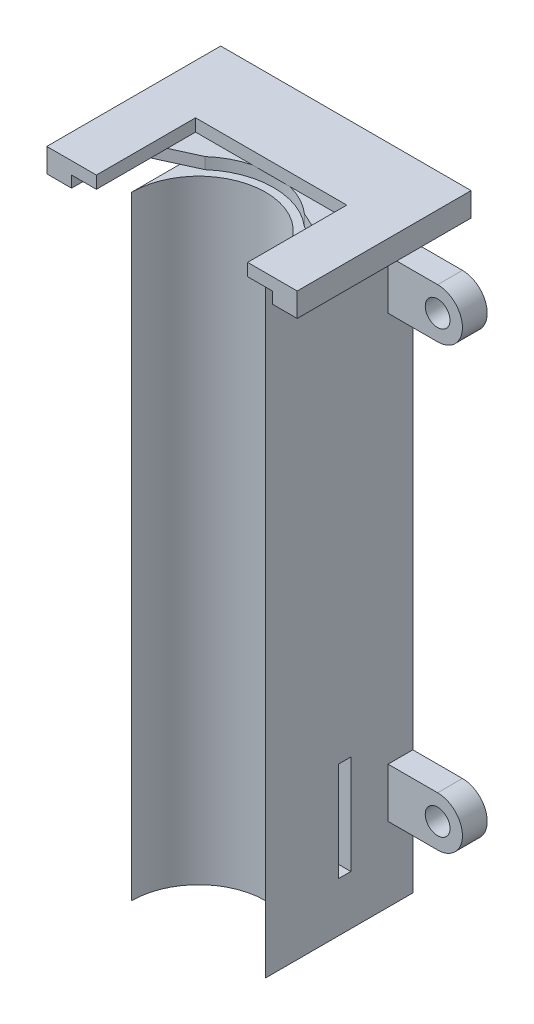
ISO-10303-21;
HEADER;
FILE_DESCRIPTION(('STEP AP214'),'2;1');
FILE_NAME('part.step','',(''),(''),'','','');
FILE_SCHEMA(('AUTOMOTIVE_DESIGN { 1 0 10303 214 1 1 1 1 }'));
ENDSEC;
DATA;
#1=APPLICATION_CONTEXT('core data for automotive mechanical design processes');
#2=APPLICATION_PROTOCOL_DEFINITION('international standard','automotive_design',2000,#1);
#3=PRODUCT_CONTEXT('',#1,'mechanical');
#4=PRODUCT('Part','Part','',(#3));
#5=PRODUCT_RELATED_PRODUCT_CATEGORY('part','',(#4));
#6=PRODUCT_DEFINITION_FORMATION('','',#4);
#7=PRODUCT_DEFINITION_CONTEXT('part definition',#1,'design');
#8=PRODUCT_DEFINITION('design','',#6,#7);
#9=PRODUCT_DEFINITION_SHAPE('','',#8);
#10=(LENGTH_UNIT() NAMED_UNIT(*) SI_UNIT(.MILLI.,.METRE.));
#11=(NAMED_UNIT(*) PLANE_ANGLE_UNIT() SI_UNIT($,.RADIAN.));
#12=(NAMED_UNIT(*) SI_UNIT($,.STERADIAN.) SOLID_ANGLE_UNIT());
#13=UNCERTAINTY_MEASURE_WITH_UNIT(LENGTH_MEASURE(1.E-05),#10,'distance_accuracy_value','');
#14=(GEOMETRIC_REPRESENTATION_CONTEXT(3) GLOBAL_UNCERTAINTY_ASSIGNED_CONTEXT((#13)) GLOBAL_UNIT_ASSIGNED_CONTEXT((#10,
#11,#12)) REPRESENTATION_CONTEXT('',''));
#15=CARTESIAN_POINT('',(0.,0.,0.));
#16=DIRECTION('',(0.,0.,1.));
#17=DIRECTION('',(1.,0.,0.));
#18=AXIS2_PLACEMENT_3D('',#15,#16,#17);
#19=CARTESIAN_POINT('',(366.113193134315,844.266861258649,1286.48711447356));
#20=DIRECTION('',(1.,0.,0.));
#21=DIRECTION('',(0.,0.,-1.));
#22=AXIS2_PLACEMENT_3D('',#19,#20,#21);
#23=PLANE('',#22);
#24=DIRECTION('',(0.,0.,-1.));
#25=VECTOR('',#24,1.);
#26=CARTESIAN_POINT('',(366.113193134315,856.966861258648,1286.48711447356));
#27=LINE('',#26,#25);
#28=CARTESIAN_POINT('',(366.113193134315,856.966861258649,1267.81303447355));
#29=VERTEX_POINT('',#28);
#30=CARTESIAN_POINT('',(366.113193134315,856.966861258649,1264.63803447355));
#31=VERTEX_POINT('',#30);
#32=EDGE_CURVE('E346',#29,#31,#27,.T.);
#33=ORIENTED_EDGE('',*,*,#32,.T.);
#34=DIRECTION('',(0.,1.,0.));
#35=VECTOR('',#34,1.);
#36=CARTESIAN_POINT('',(366.113193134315,844.266861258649,1264.63803447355));
#37=LINE('',#36,#35);
#38=CARTESIAN_POINT('',(366.113193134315,882.366861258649,1264.63803447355));
#39=VERTEX_POINT('',#38);
#40=EDGE_CURVE('E352',#31,#39,#37,.T.);
#41=ORIENTED_EDGE('',*,*,#40,.T.);
#42=DIRECTION('',(0.,0.,1.));
#43=VECTOR('',#42,1.);
#44=CARTESIAN_POINT('',(366.113193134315,882.366861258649,1286.48711447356));
#45=LINE('',#44,#43);
#46=CARTESIAN_POINT('',(366.113193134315,882.366861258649,1267.81303447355));
#47=VERTEX_POINT('',#46);
#48=EDGE_CURVE('E341',#39,#47,#45,.T.);
#49=ORIENTED_EDGE('',*,*,#48,.T.);
#50=DIRECTION('',(0.,-1.,0.));
#51=VECTOR('',#50,1.);
#52=CARTESIAN_POINT('',(366.113193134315,844.266861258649,1267.81303447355));
#53=LINE('',#52,#51);
#54=EDGE_CURVE('E323',#47,#29,#53,.T.);
#55=ORIENTED_EDGE('',*,*,#54,.T.);
#56=EDGE_LOOP('',(#33,#41,#49,#55));
#57=FACE_BOUND('',#56,.T.);
#58=DIRECTION('',(0.,0.,-1.));
#59=VECTOR('',#58,1.);
#60=CARTESIAN_POINT('',(366.113193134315,988.729361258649,1255.11303447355));
#61=LINE('',#60,#59);
#62=CARTESIAN_POINT('',(366.113193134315,988.729361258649,1255.11303447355));
#63=VERTEX_POINT('',#62);
#64=CARTESIAN_POINT('',(366.113193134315,988.729361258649,1248.76303447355));
#65=VERTEX_POINT('',#64);
#66=EDGE_CURVE('E395',#63,#65,#61,.T.);
#67=ORIENTED_EDGE('',*,*,#66,.F.);
#68=DIRECTION('',(0.,-1.,0.));
#69=VECTOR('',#68,1.);
#70=CARTESIAN_POINT('',(366.113193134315,988.729361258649,1255.11303447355));
#71=LINE('',#70,#69);
#72=CARTESIAN_POINT('',(366.113193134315,976.029361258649,1255.11303447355));
#73=VERTEX_POINT('',#72);
#74=EDGE_CURVE('E412',#63,#73,#71,.T.);
#75=ORIENTED_EDGE('',*,*,#74,.T.);
#76=DIRECTION('',(0.,0.,-1.));
#77=VECTOR('',#76,1.);
#78=CARTESIAN_POINT('',(366.113193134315,976.029361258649,1255.11303447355));
#79=LINE('',#78,#77);
#80=CARTESIAN_POINT('',(366.113193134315,976.029361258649,1248.76303447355));
#81=VERTEX_POINT('',#80);
#82=EDGE_CURVE('E393',#73,#81,#79,.T.);
#83=ORIENTED_EDGE('',*,*,#82,.T.);
#84=DIRECTION('',(0.,1.,0.));
#85=VECTOR('',#84,1.);
#86=CARTESIAN_POINT('',(366.113193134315,844.266861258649,1248.76303447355));
#87=LINE('',#86,#85);
#88=CARTESIAN_POINT('',(366.113193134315,876.016861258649,1248.76303447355));
#89=VERTEX_POINT('',#88);
#90=EDGE_CURVE('E528',#89,#81,#87,.T.);
#91=ORIENTED_EDGE('',*,*,#90,.F.);
#92=DIRECTION('',(0.,0.,-1.));
#93=VECTOR('',#92,1.);
#94=CARTESIAN_POINT('',(366.113193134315,876.016861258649,1255.11303447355));
#95=LINE('',#94,#93);
#96=CARTESIAN_POINT('',(366.113193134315,876.016861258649,1255.11303447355));
#97=VERTEX_POINT('',#96);
#98=EDGE_CURVE('E356',#97,#89,#95,.T.);
#99=ORIENTED_EDGE('',*,*,#98,.F.);
#100=DIRECTION('',(0.,-1.,0.));
#101=VECTOR('',#100,1.);
#102=CARTESIAN_POINT('',(366.113193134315,876.016861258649,1255.11303447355));
#103=LINE('',#102,#101);
#104=CARTESIAN_POINT('',(366.113193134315,863.316861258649,1255.11303447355));
#105=VERTEX_POINT('',#104);
#106=EDGE_CURVE('E380',#97,#105,#103,.T.);
#107=ORIENTED_EDGE('',*,*,#106,.T.);
#108=DIRECTION('',(0.,0.,-1.));
#109=VECTOR('',#108,1.);
#110=CARTESIAN_POINT('',(366.113193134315,863.316861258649,1255.11303447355));
#111=LINE('',#110,#109);
#112=CARTESIAN_POINT('',(366.113193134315,863.316861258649,1248.76303447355));
#113=VERTEX_POINT('',#112);
#114=EDGE_CURVE('E363',#105,#113,#111,.T.);
#115=ORIENTED_EDGE('',*,*,#114,.T.);
#116=CARTESIAN_POINT('',(366.113193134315,844.266861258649,1248.76303447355));
#117=VERTEX_POINT('',#116);
#118=EDGE_CURVE('E525',#117,#113,#87,.T.);
#119=ORIENTED_EDGE('',*,*,#118,.F.);
#120=DIRECTION('',(0.,0.,-1.));
#121=VECTOR('',#120,1.);
#122=CARTESIAN_POINT('',(366.113193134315,844.266861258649,1286.48711447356));
#123=LINE('',#122,#121);
#124=CARTESIAN_POINT('',(366.113193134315,844.266861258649,1286.48711447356));
#125=VERTEX_POINT('',#124);
#126=EDGE_CURVE('E498',#125,#117,#123,.T.);
#127=ORIENTED_EDGE('',*,*,#126,.F.);
#128=DIRECTION('',(0.,1.,0.));
#129=VECTOR('',#128,1.);
#130=CARTESIAN_POINT('',(366.113193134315,844.266861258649,1286.48711447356));
#131=LINE('',#130,#129);
#132=CARTESIAN_POINT('',(366.113193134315,1001.42936125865,1286.48711447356));
#133=VERTEX_POINT('',#132);
#134=EDGE_CURVE('E524',#125,#133,#131,.T.);
#135=ORIENTED_EDGE('',*,*,#134,.T.);
#136=DIRECTION('',(0.,0.,-1.));
#137=VECTOR('',#136,1.);
#138=CARTESIAN_POINT('',(366.113193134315,1001.42936125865,1286.48711447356));
#139=LINE('',#138,#137);
#140=CARTESIAN_POINT('',(366.113193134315,1001.42936125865,1274.11759924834));
#141=VERTEX_POINT('',#140);
#142=EDGE_CURVE('E49',#133,#141,#139,.T.);
#143=ORIENTED_EDGE('',*,*,#142,.T.);
#144=CARTESIAN_POINT('',(366.113193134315,1001.42936125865,1248.76303447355));
#145=VERTEX_POINT('',#144);
#146=EDGE_CURVE('E11',#141,#145,#139,.T.);
#147=ORIENTED_EDGE('',*,*,#146,.T.);
#148=EDGE_CURVE('E518',#65,#145,#87,.T.);
#149=ORIENTED_EDGE('',*,*,#148,.F.);
#150=EDGE_LOOP('',(#67,#75,#83,#91,#99,#107,#115,#119,#127,#135,#143,#147,#149));
#151=FACE_BOUND('',#150,.T.);
#152=ADVANCED_FACE('F39',(#57,#151),#23,.F.);
#153=CARTESIAN_POINT('',(400.403193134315,844.266861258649,1248.76303447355));
#154=DIRECTION('',(-1.,0.,0.));
#155=DIRECTION('',(0.,0.,1.));
#156=AXIS2_PLACEMENT_3D('',#153,#154,#155);
#157=PLANE('',#156);
#158=DIRECTION('',(0.,0.,1.));
#159=VECTOR('',#158,1.);
#160=CARTESIAN_POINT('',(400.403193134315,882.366861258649,1264.63803447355));
#161=LINE('',#160,#159);
#162=CARTESIAN_POINT('',(400.403193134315,882.366861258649,1264.63803447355));
#163=VERTEX_POINT('',#162);
#164=CARTESIAN_POINT('',(400.403193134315,882.366861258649,1267.81303447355));
#165=VERTEX_POINT('',#164);
#166=EDGE_CURVE('E328',#163,#165,#161,.T.);
#167=ORIENTED_EDGE('',*,*,#166,.F.);
#168=DIRECTION('',(0.,1.,0.));
#169=VECTOR('',#168,1.);
#170=CARTESIAN_POINT('',(400.403193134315,856.966861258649,1264.63803447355));
#171=LINE('',#170,#169);
#172=CARTESIAN_POINT('',(400.403193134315,856.966861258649,1264.63803447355));
#173=VERTEX_POINT('',#172);
#174=EDGE_CURVE('E63',#173,#163,#171,.T.);
#175=ORIENTED_EDGE('',*,*,#174,.F.);
#176=DIRECTION('',(0.,0.,-1.));
#177=VECTOR('',#176,1.);
#178=CARTESIAN_POINT('',(400.403193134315,856.966861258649,1264.63803447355));
#179=LINE('',#178,#177);
#180=CARTESIAN_POINT('',(400.403193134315,856.966861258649,1267.81303447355));
#181=VERTEX_POINT('',#180);
#182=EDGE_CURVE('E337',#181,#173,#179,.T.);
#183=ORIENTED_EDGE('',*,*,#182,.F.);
#184=DIRECTION('',(0.,-1.,0.));
#185=VECTOR('',#184,1.);
#186=CARTESIAN_POINT('',(400.403193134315,856.966861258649,1267.81303447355));
#187=LINE('',#186,#185);
#188=EDGE_CURVE('E319',#165,#181,#187,.T.);
#189=ORIENTED_EDGE('',*,*,#188,.F.);
#190=EDGE_LOOP('',(#167,#175,#183,#189));
#191=FACE_BOUND('',#190,.T.);
#192=DIRECTION('',(0.,0.,-1.));
#193=VECTOR('',#192,1.);
#194=CARTESIAN_POINT('',(400.403193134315,863.316861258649,1255.11303447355));
#195=LINE('',#194,#193);
#196=CARTESIAN_POINT('',(400.403193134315,863.316861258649,1255.11303447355));
#197=VERTEX_POINT('',#196);
#198=CARTESIAN_POINT('',(400.403193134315,863.316861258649,1248.76303447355));
#199=VERTEX_POINT('',#198);
#200=EDGE_CURVE('E390',#197,#199,#195,.T.);
#201=ORIENTED_EDGE('',*,*,#200,.F.);
#202=DIRECTION('',(0.,1.,0.));
#203=VECTOR('',#202,1.);
#204=CARTESIAN_POINT('',(400.403193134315,876.016861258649,1255.11303447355));
#205=LINE('',#204,#203);
#206=CARTESIAN_POINT('',(400.403193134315,876.016861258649,1255.11303447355));
#207=VERTEX_POINT('',#206);
#208=EDGE_CURVE('E442',#197,#207,#205,.T.);
#209=ORIENTED_EDGE('',*,*,#208,.T.);
#210=DIRECTION('',(0.,0.,-1.));
#211=VECTOR('',#210,1.);
#212=CARTESIAN_POINT('',(400.403193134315,876.016861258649,1255.11303447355));
#213=LINE('',#212,#211);
#214=CARTESIAN_POINT('',(400.403193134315,876.016861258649,1248.76303447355));
#215=VERTEX_POINT('',#214);
#216=EDGE_CURVE('E428',#207,#215,#213,.T.);
#217=ORIENTED_EDGE('',*,*,#216,.T.);
#218=DIRECTION('',(0.,1.,0.));
#219=VECTOR('',#218,1.);
#220=CARTESIAN_POINT('',(400.403193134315,844.266861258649,1248.76303447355));
#221=LINE('',#220,#219);
#222=CARTESIAN_POINT('',(400.403193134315,976.029361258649,1248.76303447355));
#223=VERTEX_POINT('',#222);
#224=EDGE_CURVE('E523',#215,#223,#221,.T.);
#225=ORIENTED_EDGE('',*,*,#224,.T.);
#226=DIRECTION('',(0.,0.,-1.));
#227=VECTOR('',#226,1.);
#228=CARTESIAN_POINT('',(400.403193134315,976.029361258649,1255.11303447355));
#229=LINE('',#228,#227);
#230=CARTESIAN_POINT('',(400.403193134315,976.029361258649,1255.11303447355));
#231=VERTEX_POINT('',#230);
#232=EDGE_CURVE('E488',#231,#223,#229,.T.);
#233=ORIENTED_EDGE('',*,*,#232,.F.);
#234=DIRECTION('',(0.,1.,0.));
#235=VECTOR('',#234,1.);
#236=CARTESIAN_POINT('',(400.403193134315,988.729361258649,1255.11303447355));
#237=LINE('',#236,#235);
#238=CARTESIAN_POINT('',(400.403193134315,988.729361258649,1255.11303447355));
#239=VERTEX_POINT('',#238);
#240=EDGE_CURVE('E466',#231,#239,#237,.T.);
#241=ORIENTED_EDGE('',*,*,#240,.T.);
#242=DIRECTION('',(0.,0.,-1.));
#243=VECTOR('',#242,1.);
#244=CARTESIAN_POINT('',(400.403193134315,988.729361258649,1255.11303447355));
#245=LINE('',#244,#243);
#246=CARTESIAN_POINT('',(400.403193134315,988.729361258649,1248.76303447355));
#247=VERTEX_POINT('',#246);
#248=EDGE_CURVE('E477',#239,#247,#245,.T.);
#249=ORIENTED_EDGE('',*,*,#248,.T.);
#250=CARTESIAN_POINT('',(400.403193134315,1001.42936125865,1248.76303447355));
#251=VERTEX_POINT('',#250);
#252=EDGE_CURVE('E517',#247,#251,#221,.T.);
#253=ORIENTED_EDGE('',*,*,#252,.T.);
#254=DIRECTION('',(0.,0.,1.));
#255=VECTOR('',#254,1.);
#256=CARTESIAN_POINT('',(400.403193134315,1001.42936125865,1248.76303447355));
#257=LINE('',#256,#255);
#258=CARTESIAN_POINT('',(400.403193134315,1001.42936125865,1274.11759924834));
#259=VERTEX_POINT('',#258);
#260=EDGE_CURVE('E502',#251,#259,#257,.T.);
#261=ORIENTED_EDGE('',*,*,#260,.T.);
#262=CARTESIAN_POINT('',(400.403193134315,1001.42936125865,1286.48711447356));
#263=VERTEX_POINT('',#262);
#264=EDGE_CURVE('E512',#259,#263,#257,.T.);
#265=ORIENTED_EDGE('',*,*,#264,.T.);
#266=DIRECTION('',(0.,1.,0.));
#267=VECTOR('',#266,1.);
#268=CARTESIAN_POINT('',(400.403193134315,844.266861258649,1286.48711447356));
#269=LINE('',#268,#267);
#270=CARTESIAN_POINT('',(400.403193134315,844.266861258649,1286.48711447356));
#271=VERTEX_POINT('',#270);
#272=EDGE_CURVE('E510',#271,#263,#269,.T.);
#273=ORIENTED_EDGE('',*,*,#272,.F.);
#274=DIRECTION('',(0.,0.,1.));
#275=VECTOR('',#274,1.);
#276=CARTESIAN_POINT('',(400.403193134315,844.266861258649,1248.76303447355));
#277=LINE('',#276,#275);
#278=CARTESIAN_POINT('',(400.403193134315,844.266861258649,1248.76303447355));
#279=VERTEX_POINT('',#278);
#280=EDGE_CURVE('E503',#279,#271,#277,.T.);
#281=ORIENTED_EDGE('',*,*,#280,.F.);
#282=EDGE_CURVE('E519',#279,#199,#221,.T.);
#283=ORIENTED_EDGE('',*,*,#282,.T.);
#284=EDGE_LOOP('',(#201,#209,#217,#225,#233,#241,#249,#253,#261,#265,#273,#281,#283));
#285=FACE_BOUND('',#284,.T.);
#286=ADVANCED_FACE('F334',(#191,#285),#157,.F.);
#287=CARTESIAN_POINT('',(360.080693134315,1001.42936125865,1279.66945996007));
#288=DIRECTION('',(0.,1.,0.));
#289=DIRECTION('',(0.,0.,1.));
#290=AXIS2_PLACEMENT_3D('',#287,#288,#289);
#291=PLANE('',#290);
#292=ORIENTED_EDGE('',*,*,#260,.F.);
#293=DIRECTION('',(-1.,0.,0.));
#294=VECTOR('',#293,1.);
#295=CARTESIAN_POINT('',(415.325693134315,1001.42936125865,1248.76303447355));
#296=LINE('',#295,#294);
#297=CARTESIAN_POINT('',(415.325693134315,1001.42936125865,1248.76303447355));
#298=VERTEX_POINT('',#297);
#299=EDGE_CURVE('E610',#298,#251,#296,.T.);
#300=ORIENTED_EDGE('',*,*,#299,.F.);
#301=DIRECTION('',(0.,0.,-1.));
#302=VECTOR('',#301,1.);
#303=CARTESIAN_POINT('',(415.325693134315,1001.42936125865,1293.30476898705));
#304=LINE('',#303,#302);
#305=CARTESIAN_POINT('',(415.325693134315,1001.42936125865,1293.30476898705));
#306=VERTEX_POINT('',#305);
#307=EDGE_CURVE('E602',#306,#298,#304,.T.);
#308=ORIENTED_EDGE('',*,*,#307,.F.);
#309=DIRECTION('',(1.,0.,0.));
#310=VECTOR('',#309,1.);
#311=CARTESIAN_POINT('',(408.975693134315,1001.42936125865,1293.30476898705));
#312=LINE('',#311,#310);
#313=CARTESIAN_POINT('',(408.975693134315,1001.42936125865,1293.30476898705));
#314=VERTEX_POINT('',#313);
#315=EDGE_CURVE('E599',#314,#306,#312,.T.);
#316=ORIENTED_EDGE('',*,*,#315,.F.);
#317=DIRECTION('',(0.,0.,1.));
#318=VECTOR('',#317,1.);
#319=CARTESIAN_POINT('',(408.975693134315,1001.42936125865,1293.30476898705));
#320=LINE('',#319,#318);
#321=CARTESIAN_POINT('',(408.975693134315,1001.42936125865,1279.66945996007));
#322=VERTEX_POINT('',#321);
#323=EDGE_CURVE('E600',#322,#314,#320,.T.);
#324=ORIENTED_EDGE('',*,*,#323,.F.);
#325=CARTESIAN_POINT('',(406.435693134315,1001.42936125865,1279.66945996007));
#326=DIRECTION('',(0.,-1.,0.));
#327=DIRECTION('',(0.,0.,1.));
#328=AXIS2_PLACEMENT_3D('',#325,#326,#327);
#329=CIRCLE('',#328,2.54);
#330=CARTESIAN_POINT('',(407.492079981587,1001.42936125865,1277.35955805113));
#331=VERTEX_POINT('',#330);
#332=EDGE_CURVE('E592',#331,#322,#329,.T.);
#333=ORIENTED_EDGE('',*,*,#332,.F.);
#334=DIRECTION('',(0.909410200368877,0.,0.415900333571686));
#335=VECTOR('',#334,1.);
#336=CARTESIAN_POINT('',(407.492079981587,1001.42936125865,1277.35955805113));
#337=LINE('',#336,#335);
#338=EDGE_CURVE('E587',#259,#331,#337,.T.);
#339=ORIENTED_EDGE('',*,*,#338,.F.);
#340=EDGE_LOOP('',(#292,#300,#308,#316,#324,#333,#339));
#341=FACE_BOUND('',#340,.T.);
#342=ADVANCED_FACE('F710',(#341),#291,.F.);
#343=ORIENTED_EDGE('',*,*,#146,.F.);
#344=DIRECTION('',(0.909410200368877,0.,-0.415900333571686));
#345=VECTOR('',#344,1.);
#346=CARTESIAN_POINT('',(370.556999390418,1001.42936125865,1272.08531447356));
#347=LINE('',#346,#345);
#348=CARTESIAN_POINT('',(359.024306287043,1001.42936125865,1277.35955805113));
#349=VERTEX_POINT('',#348);
#350=EDGE_CURVE('E585',#349,#141,#347,.T.);
#351=ORIENTED_EDGE('',*,*,#350,.F.);
#352=CARTESIAN_POINT('',(360.080693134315,1001.42936125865,1279.66945996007));
#353=DIRECTION('',(0.,-1.,0.));
#354=DIRECTION('',(0.,0.,1.));
#355=AXIS2_PLACEMENT_3D('',#352,#353,#354);
#356=CIRCLE('',#355,2.54);
#357=CARTESIAN_POINT('',(357.540693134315,1001.42936125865,1279.66945996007));
#358=VERTEX_POINT('',#357);
#359=EDGE_CURVE('E577',#358,#349,#356,.T.);
#360=ORIENTED_EDGE('',*,*,#359,.F.);
#361=DIRECTION('',(0.,0.,-1.));
#362=VECTOR('',#361,1.);
#363=CARTESIAN_POINT('',(357.540693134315,1001.42936125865,1279.66945996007));
#364=LINE('',#363,#362);
#365=CARTESIAN_POINT('',(357.540693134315,1001.42936125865,1293.30476898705));
#366=VERTEX_POINT('',#365);
#367=EDGE_CURVE('E618',#366,#358,#364,.T.);
#368=ORIENTED_EDGE('',*,*,#367,.F.);
#369=DIRECTION('',(1.,0.,0.));
#370=VECTOR('',#369,1.);
#371=CARTESIAN_POINT('',(351.190693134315,1001.42936125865,1293.30476898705));
#372=LINE('',#371,#370);
#373=CARTESIAN_POINT('',(351.190693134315,1001.42936125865,1293.30476898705));
#374=VERTEX_POINT('',#373);
#375=EDGE_CURVE('E615',#374,#366,#372,.T.);
#376=ORIENTED_EDGE('',*,*,#375,.F.);
#377=DIRECTION('',(0.,0.,1.));
#378=VECTOR('',#377,1.);
#379=CARTESIAN_POINT('',(351.190693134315,1001.42936125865,1248.76303447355));
#380=LINE('',#379,#378);
#381=CARTESIAN_POINT('',(351.190693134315,1001.42936125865,1248.76303447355));
#382=VERTEX_POINT('',#381);
#383=EDGE_CURVE('E608',#382,#374,#380,.T.);
#384=ORIENTED_EDGE('',*,*,#383,.F.);
#385=EDGE_CURVE('E607',#145,#382,#296,.T.);
#386=ORIENTED_EDGE('',*,*,#385,.F.);
#387=EDGE_LOOP('',(#343,#351,#360,#368,#376,#384,#386));
#388=FACE_BOUND('',#387,.T.);
#389=ADVANCED_FACE('F685',(#388),#291,.F.);
#390=CARTESIAN_POINT('',(360.080693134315,1004.35036125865,1279.66945996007));
#391=DIRECTION('',(0.,1.,0.));
#392=DIRECTION('',(0.,0.,1.));
#393=AXIS2_PLACEMENT_3D('',#390,#391,#392);
#394=PLANE('',#393);
#395=DIRECTION('',(0.,0.,1.));
#396=VECTOR('',#395,1.);
#397=CARTESIAN_POINT('',(402.625693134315,1004.35036125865,1293.30476898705));
#398=LINE('',#397,#396);
#399=CARTESIAN_POINT('',(402.625693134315,1004.35036125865,1267.90476898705));
#400=VERTEX_POINT('',#399);
#401=CARTESIAN_POINT('',(402.625693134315,1004.35036125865,1275.13401460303));
#402=VERTEX_POINT('',#401);
#403=EDGE_CURVE('E565',#400,#402,#398,.T.);
#404=ORIENTED_EDGE('',*,*,#403,.F.);
#405=DIRECTION('',(1.,0.,0.));
#406=VECTOR('',#405,1.);
#407=CARTESIAN_POINT('',(402.625693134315,1004.35036125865,1267.90476898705));
#408=LINE('',#407,#406);
#409=CARTESIAN_POINT('',(388.098503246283,1004.35036125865,1267.90476898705));
#410=VERTEX_POINT('',#409);
#411=EDGE_CURVE('E48',#410,#400,#408,.T.);
#412=ORIENTED_EDGE('',*,*,#411,.F.);
#413=CARTESIAN_POINT('',(383.258193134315,1004.35036125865,1286.48711447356));
#414=DIRECTION('',(0.,-1.,0.));
#415=DIRECTION('',(0.,0.,1.));
#416=AXIS2_PLACEMENT_3D('',#413,#414,#415);
#417=CIRCLE('',#416,19.2023999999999);
#418=CARTESIAN_POINT('',(395.959386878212,1004.35036125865,1272.08531447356));
#419=VERTEX_POINT('',#418);
#420=EDGE_CURVE('E623',#410,#419,#417,.T.);
#421=ORIENTED_EDGE('',*,*,#420,.T.);
#422=DIRECTION('',(0.909410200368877,0.,0.415900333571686));
#423=VECTOR('',#422,1.);
#424=CARTESIAN_POINT('',(407.492079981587,1004.35036125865,1277.35955805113));
#425=LINE('',#424,#423);
#426=EDGE_CURVE('E633',#419,#402,#425,.T.);
#427=ORIENTED_EDGE('',*,*,#426,.T.);
#428=EDGE_LOOP('',(#404,#412,#421,#427));
#429=FACE_BOUND('',#428,.T.);
#430=ADVANCED_FACE('F863',(#429),#394,.T.);
#431=CARTESIAN_POINT('',(360.080693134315,1001.42936125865,1279.66945996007));
#432=DIRECTION('',(0.,1.,0.));
#433=DIRECTION('',(0.,0.,1.));
#434=AXIS2_PLACEMENT_3D('',#431,#432,#433);
#435=CYLINDRICAL_SURFACE('',#434,2.54);
#436=CARTESIAN_POINT('',(360.080693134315,1004.35036125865,1279.66945996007));
#437=DIRECTION('',(0.,-1.,0.));
#438=DIRECTION('',(0.,0.,1.));
#439=AXIS2_PLACEMENT_3D('',#436,#437,#438);
#440=CIRCLE('',#439,2.54);
#441=CARTESIAN_POINT('',(357.540693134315,1004.35036125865,1279.66945996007));
#442=VERTEX_POINT('',#441);
#443=CARTESIAN_POINT('',(359.024306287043,1004.35036125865,1277.35955805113));
#444=VERTEX_POINT('',#443);
#445=EDGE_CURVE('E576',#442,#444,#440,.T.);
#446=ORIENTED_EDGE('',*,*,#445,.F.);
#447=DIRECTION('',(0.,1.,0.));
#448=VECTOR('',#447,1.);
#449=CARTESIAN_POINT('',(357.540693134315,1001.42936125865,1279.66945996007));
#450=LINE('',#449,#448);
#451=EDGE_CURVE('E645',#358,#442,#450,.T.);
#452=ORIENTED_EDGE('',*,*,#451,.F.);
#453=ORIENTED_EDGE('',*,*,#359,.T.);
#454=DIRECTION('',(0.,1.,0.));
#455=VECTOR('',#454,1.);
#456=CARTESIAN_POINT('',(359.024306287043,1001.42936125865,1277.35955805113));
#457=LINE('',#456,#455);
#458=EDGE_CURVE('E43',#349,#444,#457,.T.);
#459=ORIENTED_EDGE('',*,*,#458,.T.);
#460=EDGE_LOOP('',(#446,#452,#453,#459));
#461=FACE_BOUND('',#460,.T.);
#462=ADVANCED_FACE('F41',(#461),#435,.F.);
#463=CARTESIAN_POINT('',(357.540693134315,1001.42936125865,1279.66945996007));
#464=DIRECTION('',(1.,0.,0.));
#465=DIRECTION('',(0.,0.,-1.));
#466=AXIS2_PLACEMENT_3D('',#463,#464,#465);
#467=PLANE('',#466);
#468=DIRECTION('',(0.,0.,-1.));
#469=VECTOR('',#468,1.);
#470=CARTESIAN_POINT('',(357.540693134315,1004.35036125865,1279.66945996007));
#471=LINE('',#470,#469);
#472=CARTESIAN_POINT('',(357.540693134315,1004.35036125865,1293.30476898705));
#473=VERTEX_POINT('',#472);
#474=EDGE_CURVE('E581',#473,#442,#471,.T.);
#475=ORIENTED_EDGE('',*,*,#474,.F.);
#476=DIRECTION('',(0.,1.,0.));
#477=VECTOR('',#476,1.);
#478=CARTESIAN_POINT('',(357.540693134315,1001.42936125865,1293.30476898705));
#479=LINE('',#478,#477);
#480=EDGE_CURVE('E644',#366,#473,#479,.T.);
#481=ORIENTED_EDGE('',*,*,#480,.F.);
#482=ORIENTED_EDGE('',*,*,#367,.T.);
#483=ORIENTED_EDGE('',*,*,#451,.T.);
#484=EDGE_LOOP('',(#475,#481,#482,#483));
#485=FACE_BOUND('',#484,.T.);
#486=ADVANCED_FACE('F678',(#485),#467,.T.);
#487=CARTESIAN_POINT('',(351.190693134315,1001.42936125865,1293.30476898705));
#488=DIRECTION('',(0.,0.,1.));
#489=DIRECTION('',(0.,-1.,0.));
#490=AXIS2_PLACEMENT_3D('',#487,#488,#489);
#491=PLANE('',#490);
#492=ORIENTED_EDGE('',*,*,#480,.T.);
#493=DIRECTION('',(1.,0.,0.));
#494=VECTOR('',#493,1.);
#495=CARTESIAN_POINT('',(351.190693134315,1004.35036125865,1293.30476898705));
#496=LINE('',#495,#494);
#497=CARTESIAN_POINT('',(363.890693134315,1004.35036125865,1293.30476898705));
#498=VERTEX_POINT('',#497);
#499=EDGE_CURVE('E530',#473,#498,#496,.T.);
#500=ORIENTED_EDGE('',*,*,#499,.T.);
#501=DIRECTION('',(0.,-1.,0.));
#502=VECTOR('',#501,1.);
#503=CARTESIAN_POINT('',(363.890693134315,1007.52536125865,1293.30476898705));
#504=LINE('',#503,#502);
#505=CARTESIAN_POINT('',(363.890693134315,1007.52536125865,1293.30476898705));
#506=VERTEX_POINT('',#505);
#507=EDGE_CURVE('E573',#506,#498,#504,.T.);
#508=ORIENTED_EDGE('',*,*,#507,.F.);
#509=DIRECTION('',(1.,0.,0.));
#510=VECTOR('',#509,1.);
#511=CARTESIAN_POINT('',(351.190693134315,1007.52536125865,1293.30476898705));
#512=LINE('',#511,#510);
#513=CARTESIAN_POINT('',(351.190693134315,1007.52536125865,1293.30476898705));
#514=VERTEX_POINT('',#513);
#515=EDGE_CURVE('E539',#514,#506,#512,.T.);
#516=ORIENTED_EDGE('',*,*,#515,.F.);
#517=DIRECTION('',(0.,1.,0.));
#518=VECTOR('',#517,1.);
#519=CARTESIAN_POINT('',(351.190693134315,1001.42936125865,1293.30476898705));
#520=LINE('',#519,#518);
#521=EDGE_CURVE('E646',#374,#514,#520,.T.);
#522=ORIENTED_EDGE('',*,*,#521,.F.);
#523=ORIENTED_EDGE('',*,*,#375,.T.);
#524=EDGE_LOOP('',(#492,#500,#508,#516,#522,#523));
#525=FACE_BOUND('',#524,.T.);
#526=ADVANCED_FACE('F768',(#525),#491,.T.);
#527=CARTESIAN_POINT('',(351.190693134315,1001.42936125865,1248.76303447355));
#528=DIRECTION('',(-1.,0.,0.));
#529=DIRECTION('',(0.,0.,1.));
#530=AXIS2_PLACEMENT_3D('',#527,#528,#529);
#531=PLANE('',#530);
#532=ORIENTED_EDGE('',*,*,#521,.T.);
#533=DIRECTION('',(0.,0.,1.));
#534=VECTOR('',#533,1.);
#535=CARTESIAN_POINT('',(351.190693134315,1007.52536125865,1248.76303447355));
#536=LINE('',#535,#534);
#537=CARTESIAN_POINT('',(351.190693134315,1007.52536125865,1248.76303447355));
#538=VERTEX_POINT('',#537);
#539=EDGE_CURVE('E540',#538,#514,#536,.T.);
#540=ORIENTED_EDGE('',*,*,#539,.F.);
#541=DIRECTION('',(0.,1.,0.));
#542=VECTOR('',#541,1.);
#543=CARTESIAN_POINT('',(351.190693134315,1001.42936125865,1248.76303447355));
#544=LINE('',#543,#542);
#545=EDGE_CURVE('E648',#382,#538,#544,.T.);
#546=ORIENTED_EDGE('',*,*,#545,.F.);
#547=ORIENTED_EDGE('',*,*,#383,.T.);
#548=EDGE_LOOP('',(#532,#540,#546,#547));
#549=FACE_BOUND('',#548,.T.);
#550=ADVANCED_FACE('F774',(#549),#531,.T.);
#551=CARTESIAN_POINT('',(415.325693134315,1001.42936125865,1248.76303447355));
#552=DIRECTION('',(0.,0.,-1.));
#553=DIRECTION('',(0.,1.,0.));
#554=AXIS2_PLACEMENT_3D('',#551,#552,#553);
#555=PLANE('',#554);
#556=ORIENTED_EDGE('',*,*,#545,.T.);
#557=DIRECTION('',(-1.,0.,0.));
#558=VECTOR('',#557,1.);
#559=CARTESIAN_POINT('',(415.325693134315,1007.52536125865,1248.76303447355));
#560=LINE('',#559,#558);
#561=CARTESIAN_POINT('',(415.325693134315,1007.52536125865,1248.76303447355));
#562=VERTEX_POINT('',#561);
#563=EDGE_CURVE('E531',#562,#538,#560,.T.);
#564=ORIENTED_EDGE('',*,*,#563,.F.);
#565=DIRECTION('',(0.,1.,0.));
#566=VECTOR('',#565,1.);
#567=CARTESIAN_POINT('',(415.325693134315,1001.42936125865,1248.76303447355));
#568=LINE('',#567,#566);
#569=EDGE_CURVE('E649',#298,#562,#568,.T.);
#570=ORIENTED_EDGE('',*,*,#569,.F.);
#571=ORIENTED_EDGE('',*,*,#299,.T.);
#572=ORIENTED_EDGE('',*,*,#252,.F.);
#573=DIRECTION('',(1.,0.,0.));
#574=VECTOR('',#573,1.);
#575=CARTESIAN_POINT('',(400.403193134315,988.729361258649,1248.76303447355));
#576=LINE('',#575,#574);
#577=CARTESIAN_POINT('',(413.103193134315,988.729361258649,1248.76303447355));
#578=VERTEX_POINT('',#577);
#579=EDGE_CURVE('E463',#247,#578,#576,.T.);
#580=ORIENTED_EDGE('',*,*,#579,.T.);
#581=CARTESIAN_POINT('',(413.103193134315,982.379361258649,1248.76303447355));
#582=DIRECTION('',(0.,0.,-1.));
#583=DIRECTION('',(0.,1.,0.));
#584=AXIS2_PLACEMENT_3D('',#581,#582,#583);
#585=CIRCLE('',#584,6.35000000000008);
#586=CARTESIAN_POINT('',(413.103193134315,976.029361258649,1248.76303447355));
#587=VERTEX_POINT('',#586);
#588=EDGE_CURVE('E483',#578,#587,#585,.T.);
#589=ORIENTED_EDGE('',*,*,#588,.T.);
#590=DIRECTION('',(-1.,0.,0.));
#591=VECTOR('',#590,1.);
#592=CARTESIAN_POINT('',(400.403193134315,976.029361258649,1248.76303447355));
#593=LINE('',#592,#591);
#594=EDGE_CURVE('E473',#587,#223,#593,.T.);
#595=ORIENTED_EDGE('',*,*,#594,.T.);
#596=ORIENTED_EDGE('',*,*,#224,.F.);
#597=DIRECTION('',(1.,0.,0.));
#598=VECTOR('',#597,1.);
#599=CARTESIAN_POINT('',(413.103193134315,876.016861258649,1248.76303447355));
#600=LINE('',#599,#598);
#601=CARTESIAN_POINT('',(413.103193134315,876.016861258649,1248.76303447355));
#602=VERTEX_POINT('',#601);
#603=EDGE_CURVE('E441',#215,#602,#600,.T.);
#604=ORIENTED_EDGE('',*,*,#603,.T.);
#605=CARTESIAN_POINT('',(413.103193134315,869.666861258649,1248.76303447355));
#606=DIRECTION('',(0.,0.,-1.));
#607=DIRECTION('',(0.,-1.,0.));
#608=AXIS2_PLACEMENT_3D('',#605,#606,#607);
#609=CIRCLE('',#608,6.34999999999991);
#610=CARTESIAN_POINT('',(413.103193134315,863.316861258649,1248.76303447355));
#611=VERTEX_POINT('',#610);
#612=EDGE_CURVE('E439',#602,#611,#609,.T.);
#613=ORIENTED_EDGE('',*,*,#612,.T.);
#614=DIRECTION('',(-1.,0.,0.));
#615=VECTOR('',#614,1.);
#616=CARTESIAN_POINT('',(400.403193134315,863.316861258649,1248.76303447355));
#617=LINE('',#616,#615);
#618=EDGE_CURVE('E440',#611,#199,#617,.T.);
#619=ORIENTED_EDGE('',*,*,#618,.T.);
#620=ORIENTED_EDGE('',*,*,#282,.F.);
#621=DIRECTION('',(1.,0.,0.));
#622=VECTOR('',#621,1.);
#623=CARTESIAN_POINT('',(366.113193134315,844.266861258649,1248.76303447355));
#624=LINE('',#623,#622);
#625=EDGE_CURVE('E505',#117,#279,#624,.T.);
#626=ORIENTED_EDGE('',*,*,#625,.F.);
#627=ORIENTED_EDGE('',*,*,#118,.T.);
#628=DIRECTION('',(-1.,0.,0.));
#629=VECTOR('',#628,1.);
#630=CARTESIAN_POINT('',(366.113193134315,863.316861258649,1248.76303447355));
#631=LINE('',#630,#629);
#632=CARTESIAN_POINT('',(353.413193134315,863.316861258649,1248.76303447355));
#633=VERTEX_POINT('',#632);
#634=EDGE_CURVE('E365',#113,#633,#631,.T.);
#635=ORIENTED_EDGE('',*,*,#634,.T.);
#636=CARTESIAN_POINT('',(353.413193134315,869.666861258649,1248.76303447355));
#637=DIRECTION('',(0.,0.,-1.));
#638=DIRECTION('',(0.,1.,0.));
#639=AXIS2_PLACEMENT_3D('',#636,#637,#638);
#640=CIRCLE('',#639,6.34999999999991);
#641=CARTESIAN_POINT('',(353.413193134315,876.016861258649,1248.76303447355));
#642=VERTEX_POINT('',#641);
#643=EDGE_CURVE('E371',#633,#642,#640,.T.);
#644=ORIENTED_EDGE('',*,*,#643,.T.);
#645=DIRECTION('',(1.,0.,0.));
#646=VECTOR('',#645,1.);
#647=CARTESIAN_POINT('',(353.413193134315,876.016861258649,1248.76303447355));
#648=LINE('',#647,#646);
#649=EDGE_CURVE('E370',#642,#89,#648,.T.);
#650=ORIENTED_EDGE('',*,*,#649,.T.);
#651=ORIENTED_EDGE('',*,*,#90,.T.);
#652=DIRECTION('',(-1.,0.,0.));
#653=VECTOR('',#652,1.);
#654=CARTESIAN_POINT('',(366.113193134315,976.029361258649,1248.76303447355));
#655=LINE('',#654,#653);
#656=CARTESIAN_POINT('',(353.413193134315,976.029361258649,1248.76303447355));
#657=VERTEX_POINT('',#656);
#658=EDGE_CURVE('E402',#81,#657,#655,.T.);
#659=ORIENTED_EDGE('',*,*,#658,.T.);
#660=CARTESIAN_POINT('',(353.413193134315,982.379361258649,1248.76303447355));
#661=DIRECTION('',(0.,0.,-1.));
#662=DIRECTION('',(0.,-1.,0.));
#663=AXIS2_PLACEMENT_3D('',#660,#661,#662);
#664=CIRCLE('',#663,6.35000000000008);
#665=CARTESIAN_POINT('',(353.413193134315,988.729361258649,1248.76303447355));
#666=VERTEX_POINT('',#665);
#667=EDGE_CURVE('E410',#657,#666,#664,.T.);
#668=ORIENTED_EDGE('',*,*,#667,.T.);
#669=DIRECTION('',(1.,0.,0.));
#670=VECTOR('',#669,1.);
#671=CARTESIAN_POINT('',(366.113193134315,988.729361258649,1248.76303447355));
#672=LINE('',#671,#670);
#673=EDGE_CURVE('E404',#666,#65,#672,.T.);
#674=ORIENTED_EDGE('',*,*,#673,.T.);
#675=ORIENTED_EDGE('',*,*,#148,.T.);
#676=ORIENTED_EDGE('',*,*,#385,.T.);
#677=EDGE_LOOP('',(#556,#564,#570,#571,#572,#580,#589,#595,#596,#604,#613,#619,#620,#626,#627,
#635,#644,#650,#651,#659,#668,#674,#675,#676));
#678=FACE_BOUND('',#677,.T.);
#679=CARTESIAN_POINT('',(413.103193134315,982.379361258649,1248.76303447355));
#680=DIRECTION('',(0.,0.,-1.));
#681=DIRECTION('',(0.,1.,0.));
#682=AXIS2_PLACEMENT_3D('',#679,#680,#681);
#683=CIRCLE('',#682,3.17499999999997);
#684=CARTESIAN_POINT('',(413.103193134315,985.554361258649,1248.76303447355));
#685=VERTEX_POINT('',#684);
#686=EDGE_CURVE('E422',#685,#685,#683,.T.);
#687=ORIENTED_EDGE('',*,*,#686,.F.);
#688=EDGE_LOOP('',(#687));
#689=FACE_BOUND('',#688,.T.);
#690=CARTESIAN_POINT('',(353.413193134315,869.666861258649,1248.76303447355));
#691=DIRECTION('',(0.,0.,-1.));
#692=DIRECTION('',(0.,-1.,0.));
#693=AXIS2_PLACEMENT_3D('',#690,#691,#692);
#694=CIRCLE('',#693,3.17499999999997);
#695=CARTESIAN_POINT('',(353.413193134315,866.491861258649,1248.76303447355));
#696=VERTEX_POINT('',#695);
#697=EDGE_CURVE('E383',#696,#696,#694,.T.);
#698=ORIENTED_EDGE('',*,*,#697,.F.);
#699=EDGE_LOOP('',(#698));
#700=FACE_BOUND('',#699,.T.);
#701=CARTESIAN_POINT('',(413.103193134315,869.666861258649,1248.76303447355));
#702=DIRECTION('',(0.,0.,-1.));
#703=DIRECTION('',(0.,1.,0.));
#704=AXIS2_PLACEMENT_3D('',#701,#702,#703);
#705=CIRCLE('',#704,3.17499999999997);
#706=CARTESIAN_POINT('',(413.103193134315,872.841861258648,1248.76303447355));
#707=VERTEX_POINT('',#706);
#708=EDGE_CURVE('E399',#707,#707,#705,.T.);
#709=ORIENTED_EDGE('',*,*,#708,.F.);
#710=EDGE_LOOP('',(#709));
#711=FACE_BOUND('',#710,.T.);
#712=CARTESIAN_POINT('',(353.413193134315,982.379361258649,1248.76303447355));
#713=DIRECTION('',(0.,0.,-1.));
#714=DIRECTION('',(0.,-1.,0.));
#715=AXIS2_PLACEMENT_3D('',#712,#713,#714);
#716=CIRCLE('',#715,3.17499999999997);
#717=CARTESIAN_POINT('',(353.413193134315,979.204361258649,1248.76303447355));
#718=VERTEX_POINT('',#717);
#719=EDGE_CURVE('E425',#718,#718,#716,.T.);
#720=ORIENTED_EDGE('',*,*,#719,.F.);
#721=EDGE_LOOP('',(#720));
#722=FACE_BOUND('',#721,.T.);
#723=ADVANCED_FACE('F711',(#678,#689,#700,#711,#722),#555,.T.);
#724=CARTESIAN_POINT('',(415.325693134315,1001.42936125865,1293.30476898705));
#725=DIRECTION('',(1.,0.,0.));
#726=DIRECTION('',(0.,0.,-1.));
#727=AXIS2_PLACEMENT_3D('',#724,#725,#726);
#728=PLANE('',#727);
#729=ORIENTED_EDGE('',*,*,#569,.T.);
#730=DIRECTION('',(0.,0.,-1.));
#731=VECTOR('',#730,1.);
#732=CARTESIAN_POINT('',(415.325693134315,1007.52536125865,1293.30476898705));
#733=LINE('',#732,#731);
#734=CARTESIAN_POINT('',(415.325693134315,1007.52536125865,1293.30476898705));
#735=VERTEX_POINT('',#734);
#736=EDGE_CURVE('E529',#735,#562,#733,.T.);
#737=ORIENTED_EDGE('',*,*,#736,.F.);
#738=DIRECTION('',(0.,1.,0.));
#739=VECTOR('',#738,1.);
#740=CARTESIAN_POINT('',(415.325693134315,1001.42936125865,1293.30476898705));
#741=LINE('',#740,#739);
#742=EDGE_CURVE('E655',#306,#735,#741,.T.);
#743=ORIENTED_EDGE('',*,*,#742,.F.);
#744=ORIENTED_EDGE('',*,*,#307,.T.);
#745=EDGE_LOOP('',(#729,#737,#743,#744));
#746=FACE_BOUND('',#745,.T.);
#747=ADVANCED_FACE('F720',(#746),#728,.T.);
#748=CARTESIAN_POINT('',(408.975693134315,1001.42936125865,1293.30476898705));
#749=DIRECTION('',(0.,0.,1.));
#750=DIRECTION('',(0.,-1.,0.));
#751=AXIS2_PLACEMENT_3D('',#748,#749,#750);
#752=PLANE('',#751);
#753=ORIENTED_EDGE('',*,*,#742,.T.);
#754=DIRECTION('',(1.,0.,0.));
#755=VECTOR('',#754,1.);
#756=CARTESIAN_POINT('',(415.325693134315,1007.52536125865,1293.30476898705));
#757=LINE('',#756,#755);
#758=CARTESIAN_POINT('',(402.625693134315,1007.52536125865,1293.30476898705));
#759=VERTEX_POINT('',#758);
#760=EDGE_CURVE('E547',#759,#735,#757,.T.);
#761=ORIENTED_EDGE('',*,*,#760,.F.);
#762=DIRECTION('',(0.,-1.,0.));
#763=VECTOR('',#762,1.);
#764=CARTESIAN_POINT('',(402.625693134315,1007.52536125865,1293.30476898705));
#765=LINE('',#764,#763);
#766=CARTESIAN_POINT('',(402.625693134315,1004.35036125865,1293.30476898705));
#767=VERTEX_POINT('',#766);
#768=EDGE_CURVE('E552',#759,#767,#765,.T.);
#769=ORIENTED_EDGE('',*,*,#768,.T.);
#770=DIRECTION('',(1.,0.,0.));
#771=VECTOR('',#770,1.);
#772=CARTESIAN_POINT('',(415.325693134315,1004.35036125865,1293.30476898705));
#773=LINE('',#772,#771);
#774=CARTESIAN_POINT('',(408.975693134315,1004.35036125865,1293.30476898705));
#775=VERTEX_POINT('',#774);
#776=EDGE_CURVE('E534',#767,#775,#773,.T.);
#777=ORIENTED_EDGE('',*,*,#776,.T.);
#778=DIRECTION('',(0.,1.,0.));
#779=VECTOR('',#778,1.);
#780=CARTESIAN_POINT('',(408.975693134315,1001.42936125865,1293.30476898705));
#781=LINE('',#780,#779);
#782=EDGE_CURVE('E652',#314,#775,#781,.T.);
#783=ORIENTED_EDGE('',*,*,#782,.F.);
#784=ORIENTED_EDGE('',*,*,#315,.T.);
#785=EDGE_LOOP('',(#753,#761,#769,#777,#783,#784));
#786=FACE_BOUND('',#785,.T.);
#787=ADVANCED_FACE('F722',(#786),#752,.T.);
#788=CARTESIAN_POINT('',(408.975693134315,1001.42936125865,1293.30476898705));
#789=DIRECTION('',(-1.,0.,0.));
#790=DIRECTION('',(0.,0.,1.));
#791=AXIS2_PLACEMENT_3D('',#788,#789,#790);
#792=PLANE('',#791);
#793=DIRECTION('',(0.,0.,1.));
#794=VECTOR('',#793,1.);
#795=CARTESIAN_POINT('',(408.975693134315,1004.35036125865,1293.30476898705));
#796=LINE('',#795,#794);
#797=CARTESIAN_POINT('',(408.975693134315,1004.35036125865,1279.66945996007));
#798=VERTEX_POINT('',#797);
#799=EDGE_CURVE('E637',#798,#775,#796,.T.);
#800=ORIENTED_EDGE('',*,*,#799,.F.);
#801=DIRECTION('',(0.,1.,0.));
#802=VECTOR('',#801,1.);
#803=CARTESIAN_POINT('',(408.975693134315,1001.42936125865,1279.66945996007));
#804=LINE('',#803,#802);
#805=EDGE_CURVE('E656',#322,#798,#804,.T.);
#806=ORIENTED_EDGE('',*,*,#805,.F.);
#807=ORIENTED_EDGE('',*,*,#323,.T.);
#808=ORIENTED_EDGE('',*,*,#782,.T.);
#809=EDGE_LOOP('',(#800,#806,#807,#808));
#810=FACE_BOUND('',#809,.T.);
#811=ADVANCED_FACE('F728',(#810),#792,.T.);
#812=CARTESIAN_POINT('',(406.435693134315,1001.42936125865,1279.66945996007));
#813=DIRECTION('',(0.,1.,0.));
#814=DIRECTION('',(0.,0.,1.));
#815=AXIS2_PLACEMENT_3D('',#812,#813,#814);
#816=CYLINDRICAL_SURFACE('',#815,2.54);
#817=CARTESIAN_POINT('',(406.435693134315,1004.35036125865,1279.66945996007));
#818=DIRECTION('',(0.,-1.,0.));
#819=DIRECTION('',(0.,0.,1.));
#820=AXIS2_PLACEMENT_3D('',#817,#818,#819);
#821=CIRCLE('',#820,2.54);
#822=CARTESIAN_POINT('',(407.492079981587,1004.35036125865,1277.35955805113));
#823=VERTEX_POINT('',#822);
#824=EDGE_CURVE('E632',#823,#798,#821,.T.);
#825=ORIENTED_EDGE('',*,*,#824,.F.);
#826=DIRECTION('',(0.,1.,0.));
#827=VECTOR('',#826,1.);
#828=CARTESIAN_POINT('',(407.492079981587,1001.42936125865,1277.35955805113));
#829=LINE('',#828,#827);
#830=EDGE_CURVE('E657',#331,#823,#829,.T.);
#831=ORIENTED_EDGE('',*,*,#830,.F.);
#832=ORIENTED_EDGE('',*,*,#332,.T.);
#833=ORIENTED_EDGE('',*,*,#805,.T.);
#834=EDGE_LOOP('',(#825,#831,#832,#833));
#835=FACE_BOUND('',#834,.T.);
#836=ADVANCED_FACE('F734',(#835),#816,.F.);
#837=CARTESIAN_POINT('',(407.492079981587,1001.42936125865,1277.35955805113));
#838=DIRECTION('',(-0.415900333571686,0.,0.909410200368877));
#839=DIRECTION('',(0.909410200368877,0.,0.415900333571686));
#840=AXIS2_PLACEMENT_3D('',#837,#838,#839);
#841=PLANE('',#840);
#842=ORIENTED_EDGE('',*,*,#426,.F.);
#843=DIRECTION('',(0.,1.,0.));
#844=VECTOR('',#843,1.);
#845=CARTESIAN_POINT('',(395.959386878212,1001.42936125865,1272.08531447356));
#846=LINE('',#845,#844);
#847=CARTESIAN_POINT('',(395.959386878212,1001.42936125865,1272.08531447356));
#848=VERTEX_POINT('',#847);
#849=EDGE_CURVE('E659',#848,#419,#846,.T.);
#850=ORIENTED_EDGE('',*,*,#849,.F.);
#851=EDGE_CURVE('E591',#848,#259,#337,.T.);
#852=ORIENTED_EDGE('',*,*,#851,.T.);
#853=ORIENTED_EDGE('',*,*,#338,.T.);
#854=ORIENTED_EDGE('',*,*,#830,.T.);
#855=EDGE_CURVE('E626',#402,#823,#425,.T.);
#856=ORIENTED_EDGE('',*,*,#855,.F.);
#857=EDGE_LOOP('',(#842,#850,#852,#853,#854,#856));
#858=FACE_BOUND('',#857,.T.);
#859=ADVANCED_FACE('F739',(#858),#841,.T.);
#860=CARTESIAN_POINT('',(383.258193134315,1001.42936125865,1286.48711447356));
#861=DIRECTION('',(0.,1.,0.));
#862=DIRECTION('',(0.,0.,1.));
#863=AXIS2_PLACEMENT_3D('',#860,#861,#862);
#864=CYLINDRICAL_SURFACE('',#863,19.2023999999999);
#865=CARTESIAN_POINT('',(370.556999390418,1004.35036125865,1272.08531447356));
#866=VERTEX_POINT('',#865);
#867=CARTESIAN_POINT('',(378.417883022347,1004.35036125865,1267.90476898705));
#868=VERTEX_POINT('',#867);
#869=EDGE_CURVE('E627',#866,#868,#417,.T.);
#870=ORIENTED_EDGE('',*,*,#869,.F.);
#871=DIRECTION('',(0.,1.,0.));
#872=VECTOR('',#871,1.);
#873=CARTESIAN_POINT('',(370.556999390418,1001.42936125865,1272.08531447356));
#874=LINE('',#873,#872);
#875=CARTESIAN_POINT('',(370.556999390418,1001.42936125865,1272.08531447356));
#876=VERTEX_POINT('',#875);
#877=EDGE_CURVE('E665',#876,#866,#874,.T.);
#878=ORIENTED_EDGE('',*,*,#877,.F.);
#879=CARTESIAN_POINT('',(383.258193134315,1001.42936125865,1286.48711447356));
#880=DIRECTION('',(0.,-1.,0.));
#881=DIRECTION('',(0.,0.,1.));
#882=AXIS2_PLACEMENT_3D('',#879,#880,#881);
#883=CIRCLE('',#882,19.2023999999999);
#884=EDGE_CURVE('E590',#876,#848,#883,.T.);
#885=ORIENTED_EDGE('',*,*,#884,.T.);
#886=ORIENTED_EDGE('',*,*,#849,.T.);
#887=ORIENTED_EDGE('',*,*,#420,.F.);
#888=EDGE_CURVE('E628',#868,#410,#417,.T.);
#889=ORIENTED_EDGE('',*,*,#888,.F.);
#890=EDGE_LOOP('',(#870,#878,#885,#886,#887,#889));
#891=FACE_BOUND('',#890,.T.);
#892=ADVANCED_FACE('F738',(#891),#864,.F.);
#893=CARTESIAN_POINT('',(370.556999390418,1001.42936125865,1272.08531447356));
#894=DIRECTION('',(0.415900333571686,0.,0.909410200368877));
#895=DIRECTION('',(0.909410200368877,0.,-0.415900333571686));
#896=AXIS2_PLACEMENT_3D('',#893,#894,#895);
#897=PLANE('',#896);
#898=DIRECTION('',(0.909410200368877,0.,-0.415900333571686));
#899=VECTOR('',#898,1.);
#900=CARTESIAN_POINT('',(370.556999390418,1004.35036125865,1272.08531447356));
#901=LINE('',#900,#899);
#902=CARTESIAN_POINT('',(363.890693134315,1004.35036125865,1275.13401460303));
#903=VERTEX_POINT('',#902);
#904=EDGE_CURVE('E625',#444,#903,#901,.T.);
#905=ORIENTED_EDGE('',*,*,#904,.F.);
#906=ORIENTED_EDGE('',*,*,#458,.F.);
#907=ORIENTED_EDGE('',*,*,#350,.T.);
#908=EDGE_CURVE('E582',#141,#876,#347,.T.);
#909=ORIENTED_EDGE('',*,*,#908,.T.);
#910=ORIENTED_EDGE('',*,*,#877,.T.);
#911=EDGE_CURVE('E622',#903,#866,#901,.T.);
#912=ORIENTED_EDGE('',*,*,#911,.F.);
#913=EDGE_LOOP('',(#905,#906,#907,#909,#910,#912));
#914=FACE_BOUND('',#913,.T.);
#915=ADVANCED_FACE('F671',(#914),#897,.T.);
#916=CARTESIAN_POINT('',(363.890693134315,1004.35036125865,1267.90476898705));
#917=VERTEX_POINT('',#916);
#918=EDGE_CURVE('E560',#917,#868,#408,.T.);
#919=ORIENTED_EDGE('',*,*,#918,.F.);
#920=DIRECTION('',(0.,0.,-1.));
#921=VECTOR('',#920,1.);
#922=CARTESIAN_POINT('',(363.890693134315,1004.35036125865,1293.30476898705));
#923=LINE('',#922,#921);
#924=EDGE_CURVE('E559',#903,#917,#923,.T.);
#925=ORIENTED_EDGE('',*,*,#924,.F.);
#926=ORIENTED_EDGE('',*,*,#911,.T.);
#927=ORIENTED_EDGE('',*,*,#869,.T.);
#928=EDGE_LOOP('',(#919,#925,#926,#927));
#929=FACE_BOUND('',#928,.T.);
#930=ADVANCED_FACE('F742',(#929),#394,.T.);
#931=CARTESIAN_POINT('',(0.,1004.35036125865,0.));
#932=DIRECTION('',(0.,1.,0.));
#933=DIRECTION('',(0.,0.,1.));
#934=AXIS2_PLACEMENT_3D('',#931,#932,#933);
#935=PLANE('',#934);
#936=EDGE_CURVE('E557',#868,#410,#408,.T.);
#937=ORIENTED_EDGE('',*,*,#936,.F.);
#938=ORIENTED_EDGE('',*,*,#888,.T.);
#939=EDGE_LOOP('',(#937,#938));
#940=FACE_BOUND('',#939,.T.);
#941=ADVANCED_FACE('F746',(#940),#935,.F.);
#942=EDGE_CURVE('E563',#402,#767,#398,.T.);
#943=ORIENTED_EDGE('',*,*,#942,.F.);
#944=ORIENTED_EDGE('',*,*,#855,.T.);
#945=ORIENTED_EDGE('',*,*,#824,.T.);
#946=ORIENTED_EDGE('',*,*,#799,.T.);
#947=ORIENTED_EDGE('',*,*,#776,.F.);
#948=EDGE_LOOP('',(#943,#944,#945,#946,#947));
#949=FACE_BOUND('',#948,.T.);
#950=ADVANCED_FACE('F727',(#949),#935,.F.);
#951=ORIENTED_EDGE('',*,*,#445,.T.);
#952=ORIENTED_EDGE('',*,*,#904,.T.);
#953=EDGE_CURVE('E554',#498,#903,#923,.T.);
#954=ORIENTED_EDGE('',*,*,#953,.F.);
#955=ORIENTED_EDGE('',*,*,#499,.F.);
#956=ORIENTED_EDGE('',*,*,#474,.T.);
#957=EDGE_LOOP('',(#951,#952,#954,#955,#956));
#958=FACE_BOUND('',#957,.T.);
#959=ADVANCED_FACE('F677',(#958),#935,.F.);
#960=CARTESIAN_POINT('',(363.890693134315,1007.52536125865,1293.30476898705));
#961=DIRECTION('',(-1.,0.,0.));
#962=DIRECTION('',(0.,0.,1.));
#963=AXIS2_PLACEMENT_3D('',#960,#961,#962);
#964=PLANE('',#963);
#965=ORIENTED_EDGE('',*,*,#953,.T.);
#966=ORIENTED_EDGE('',*,*,#924,.T.);
#967=DIRECTION('',(0.,-1.,0.));
#968=VECTOR('',#967,1.);
#969=CARTESIAN_POINT('',(363.890693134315,1007.52536125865,1267.90476898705));
#970=LINE('',#969,#968);
#971=CARTESIAN_POINT('',(363.890693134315,1007.52536125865,1267.90476898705));
#972=VERTEX_POINT('',#971);
#973=EDGE_CURVE('E574',#972,#917,#970,.T.);
#974=ORIENTED_EDGE('',*,*,#973,.F.);
#975=DIRECTION('',(0.,0.,-1.));
#976=VECTOR('',#975,1.);
#977=CARTESIAN_POINT('',(363.890693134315,1007.52536125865,1293.30476898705));
#978=LINE('',#977,#976);
#979=EDGE_CURVE('E545',#506,#972,#978,.T.);
#980=ORIENTED_EDGE('',*,*,#979,.F.);
#981=ORIENTED_EDGE('',*,*,#507,.T.);
#982=EDGE_LOOP('',(#965,#966,#974,#980,#981));
#983=FACE_BOUND('',#982,.T.);
#984=ADVANCED_FACE('F760',(#983),#964,.F.);
#985=CARTESIAN_POINT('',(402.625693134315,1007.52536125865,1267.90476898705));
#986=DIRECTION('',(0.,0.,-1.));
#987=DIRECTION('',(0.,1.,0.));
#988=AXIS2_PLACEMENT_3D('',#985,#986,#987);
#989=PLANE('',#988);
#990=ORIENTED_EDGE('',*,*,#918,.T.);
#991=ORIENTED_EDGE('',*,*,#936,.T.);
#992=ORIENTED_EDGE('',*,*,#411,.T.);
#993=DIRECTION('',(0.,-1.,0.));
#994=VECTOR('',#993,1.);
#995=CARTESIAN_POINT('',(402.625693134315,1007.52536125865,1267.90476898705));
#996=LINE('',#995,#994);
#997=CARTESIAN_POINT('',(402.625693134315,1007.52536125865,1267.90476898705));
#998=VERTEX_POINT('',#997);
#999=EDGE_CURVE('E569',#998,#400,#996,.T.);
#1000=ORIENTED_EDGE('',*,*,#999,.F.);
#1001=DIRECTION('',(1.,0.,0.));
#1002=VECTOR('',#1001,1.);
#1003=CARTESIAN_POINT('',(402.625693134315,1007.52536125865,1267.90476898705));
#1004=LINE('',#1003,#1002);
#1005=EDGE_CURVE('E542',#972,#998,#1004,.T.);
#1006=ORIENTED_EDGE('',*,*,#1005,.F.);
#1007=ORIENTED_EDGE('',*,*,#973,.T.);
#1008=EDGE_LOOP('',(#990,#991,#992,#1000,#1006,#1007));
#1009=FACE_BOUND('',#1008,.T.);
#1010=ADVANCED_FACE('F753',(#1009),#989,.F.);
#1011=CARTESIAN_POINT('',(402.625693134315,1007.52536125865,1293.30476898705));
#1012=DIRECTION('',(1.,0.,0.));
#1013=DIRECTION('',(0.,0.,-1.));
#1014=AXIS2_PLACEMENT_3D('',#1011,#1012,#1013);
#1015=PLANE('',#1014);
#1016=ORIENTED_EDGE('',*,*,#403,.T.);
#1017=ORIENTED_EDGE('',*,*,#942,.T.);
#1018=ORIENTED_EDGE('',*,*,#768,.F.);
#1019=DIRECTION('',(0.,0.,1.));
#1020=VECTOR('',#1019,1.);
#1021=CARTESIAN_POINT('',(402.625693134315,1007.52536125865,1293.30476898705));
#1022=LINE('',#1021,#1020);
#1023=EDGE_CURVE('E546',#998,#759,#1022,.T.);
#1024=ORIENTED_EDGE('',*,*,#1023,.F.);
#1025=ORIENTED_EDGE('',*,*,#999,.T.);
#1026=EDGE_LOOP('',(#1016,#1017,#1018,#1024,#1025));
#1027=FACE_BOUND('',#1026,.T.);
#1028=ADVANCED_FACE('F761',(#1027),#1015,.F.);
#1029=CARTESIAN_POINT('',(0.,1007.52536125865,0.));
#1030=DIRECTION('',(0.,1.,0.));
#1031=DIRECTION('',(0.,0.,1.));
#1032=AXIS2_PLACEMENT_3D('',#1029,#1030,#1031);
#1033=PLANE('',#1032);
#1034=ORIENTED_EDGE('',*,*,#736,.T.);
#1035=ORIENTED_EDGE('',*,*,#563,.T.);
#1036=ORIENTED_EDGE('',*,*,#539,.T.);
#1037=ORIENTED_EDGE('',*,*,#515,.T.);
#1038=ORIENTED_EDGE('',*,*,#979,.T.);
#1039=ORIENTED_EDGE('',*,*,#1005,.T.);
#1040=ORIENTED_EDGE('',*,*,#1023,.T.);
#1041=ORIENTED_EDGE('',*,*,#760,.T.);
#1042=EDGE_LOOP('',(#1034,#1035,#1036,#1037,#1038,#1039,#1040,#1041));
#1043=FACE_BOUND('',#1042,.T.);
#1044=ADVANCED_FACE('F762',(#1043),#1033,.T.);
#1045=CARTESIAN_POINT('',(383.258193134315,844.266861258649,1286.48711447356));
#1046=DIRECTION('',(0.,1.,0.));
#1047=DIRECTION('',(0.,0.,1.));
#1048=AXIS2_PLACEMENT_3D('',#1045,#1046,#1047);
#1049=CYLINDRICAL_SURFACE('',#1048,17.145);
#1050=CARTESIAN_POINT('',(383.258193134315,1001.42936125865,1286.48711447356));
#1051=DIRECTION('',(0.,1.,0.));
#1052=DIRECTION('',(0.,0.,-1.));
#1053=AXIS2_PLACEMENT_3D('',#1050,#1051,#1052);
#1054=CIRCLE('',#1053,17.145);
#1055=EDGE_CURVE('E491',#263,#133,#1054,.T.);
#1056=ORIENTED_EDGE('',*,*,#1055,.T.);
#1057=ORIENTED_EDGE('',*,*,#134,.F.);
#1058=CARTESIAN_POINT('',(383.258193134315,844.266861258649,1286.48711447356));
#1059=DIRECTION('',(0.,1.,0.));
#1060=DIRECTION('',(0.,0.,-1.));
#1061=AXIS2_PLACEMENT_3D('',#1058,#1059,#1060);
#1062=CIRCLE('',#1061,17.145);
#1063=EDGE_CURVE('E500',#271,#125,#1062,.T.);
#1064=ORIENTED_EDGE('',*,*,#1063,.F.);
#1065=ORIENTED_EDGE('',*,*,#272,.T.);
#1066=EDGE_LOOP('',(#1056,#1057,#1064,#1065));
#1067=FACE_BOUND('',#1066,.T.);
#1068=ADVANCED_FACE('F699',(#1067),#1049,.F.);
#1069=CARTESIAN_POINT('',(383.258193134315,844.266861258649,1286.48711447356));
#1070=DIRECTION('',(0.,-1.,0.));
#1071=DIRECTION('',(0.,0.,-1.));
#1072=AXIS2_PLACEMENT_3D('',#1069,#1070,#1071);
#1073=PLANE('',#1072);
#1074=ORIENTED_EDGE('',*,*,#1063,.T.);
#1075=ORIENTED_EDGE('',*,*,#126,.T.);
#1076=ORIENTED_EDGE('',*,*,#625,.T.);
#1077=ORIENTED_EDGE('',*,*,#280,.T.);
#1078=EDGE_LOOP('',(#1074,#1075,#1076,#1077));
#1079=FACE_BOUND('',#1078,.T.);
#1080=ADVANCED_FACE('F800',(#1079),#1073,.T.);
#1081=CARTESIAN_POINT('',(383.258193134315,1001.42936125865,1286.48711447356));
#1082=DIRECTION('',(0.,-1.,0.));
#1083=DIRECTION('',(0.,0.,-1.));
#1084=AXIS2_PLACEMENT_3D('',#1081,#1082,#1083);
#1085=PLANE('',#1084);
#1086=ORIENTED_EDGE('',*,*,#851,.F.);
#1087=ORIENTED_EDGE('',*,*,#884,.F.);
#1088=ORIENTED_EDGE('',*,*,#908,.F.);
#1089=ORIENTED_EDGE('',*,*,#142,.F.);
#1090=ORIENTED_EDGE('',*,*,#1055,.F.);
#1091=ORIENTED_EDGE('',*,*,#264,.F.);
#1092=EDGE_LOOP('',(#1086,#1087,#1088,#1089,#1090,#1091));
#1093=FACE_BOUND('',#1092,.T.);
#1094=ADVANCED_FACE('F689',(#1093),#1085,.F.);
#1095=CARTESIAN_POINT('',(400.403193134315,976.029361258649,1255.11303447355));
#1096=DIRECTION('',(0.,-1.,0.));
#1097=DIRECTION('',(0.,0.,-1.));
#1098=AXIS2_PLACEMENT_3D('',#1095,#1096,#1097);
#1099=PLANE('',#1098);
#1100=ORIENTED_EDGE('',*,*,#594,.F.);
#1101=DIRECTION('',(0.,0.,-1.));
#1102=VECTOR('',#1101,1.);
#1103=CARTESIAN_POINT('',(413.103193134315,976.029361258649,1255.11303447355));
#1104=LINE('',#1103,#1102);
#1105=CARTESIAN_POINT('',(413.103193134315,976.029361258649,1255.11303447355));
#1106=VERTEX_POINT('',#1105);
#1107=EDGE_CURVE('E495',#1106,#587,#1104,.T.);
#1108=ORIENTED_EDGE('',*,*,#1107,.F.);
#1109=DIRECTION('',(-1.,0.,0.));
#1110=VECTOR('',#1109,1.);
#1111=CARTESIAN_POINT('',(400.403193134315,976.029361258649,1255.11303447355));
#1112=LINE('',#1111,#1110);
#1113=EDGE_CURVE('E480',#1106,#231,#1112,.T.);
#1114=ORIENTED_EDGE('',*,*,#1113,.T.);
#1115=ORIENTED_EDGE('',*,*,#232,.T.);
#1116=EDGE_LOOP('',(#1100,#1108,#1114,#1115));
#1117=FACE_BOUND('',#1116,.T.);
#1118=ADVANCED_FACE('F814',(#1117),#1099,.T.);
#1119=CARTESIAN_POINT('',(413.103193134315,982.379361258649,1255.11303447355));
#1120=DIRECTION('',(0.,0.,-1.));
#1121=DIRECTION('',(0.,1.,0.));
#1122=AXIS2_PLACEMENT_3D('',#1119,#1120,#1121);
#1123=CYLINDRICAL_SURFACE('',#1122,6.35000000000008);
#1124=ORIENTED_EDGE('',*,*,#588,.F.);
#1125=DIRECTION('',(0.,0.,-1.));
#1126=VECTOR('',#1125,1.);
#1127=CARTESIAN_POINT('',(413.103193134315,988.729361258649,1255.11303447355));
#1128=LINE('',#1127,#1126);
#1129=CARTESIAN_POINT('',(413.103193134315,988.729361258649,1255.11303447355));
#1130=VERTEX_POINT('',#1129);
#1131=EDGE_CURVE('E493',#1130,#578,#1128,.T.);
#1132=ORIENTED_EDGE('',*,*,#1131,.F.);
#1133=CARTESIAN_POINT('',(413.103193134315,982.379361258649,1255.11303447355));
#1134=DIRECTION('',(0.,0.,-1.));
#1135=DIRECTION('',(0.,1.,0.));
#1136=AXIS2_PLACEMENT_3D('',#1133,#1134,#1135);
#1137=CIRCLE('',#1136,6.35000000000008);
#1138=EDGE_CURVE('E475',#1130,#1106,#1137,.T.);
#1139=ORIENTED_EDGE('',*,*,#1138,.T.);
#1140=ORIENTED_EDGE('',*,*,#1107,.T.);
#1141=EDGE_LOOP('',(#1124,#1132,#1139,#1140));
#1142=FACE_BOUND('',#1141,.T.);
#1143=ADVANCED_FACE('F827',(#1142),#1123,.T.);
#1144=CARTESIAN_POINT('',(400.403193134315,988.729361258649,1255.11303447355));
#1145=DIRECTION('',(0.,1.,0.));
#1146=DIRECTION('',(-1.,0.,0.));
#1147=AXIS2_PLACEMENT_3D('',#1144,#1145,#1146);
#1148=PLANE('',#1147);
#1149=ORIENTED_EDGE('',*,*,#579,.F.);
#1150=ORIENTED_EDGE('',*,*,#248,.F.);
#1151=DIRECTION('',(1.,0.,0.));
#1152=VECTOR('',#1151,1.);
#1153=CARTESIAN_POINT('',(400.403193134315,988.729361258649,1255.11303447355));
#1154=LINE('',#1153,#1152);
#1155=EDGE_CURVE('E469',#239,#1130,#1154,.T.);
#1156=ORIENTED_EDGE('',*,*,#1155,.T.);
#1157=ORIENTED_EDGE('',*,*,#1131,.T.);
#1158=EDGE_LOOP('',(#1149,#1150,#1156,#1157));
#1159=FACE_BOUND('',#1158,.T.);
#1160=ADVANCED_FACE('F823',(#1159),#1148,.T.);
#1161=CARTESIAN_POINT('',(413.103193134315,982.379361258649,1255.11303447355));
#1162=DIRECTION('',(0.,0.,-1.));
#1163=DIRECTION('',(0.,1.,0.));
#1164=AXIS2_PLACEMENT_3D('',#1161,#1162,#1163);
#1165=PLANE('',#1164);
#1166=CARTESIAN_POINT('',(413.103193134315,982.379361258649,1255.11303447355));
#1167=DIRECTION('',(0.,0.,-1.));
#1168=DIRECTION('',(0.,1.,0.));
#1169=AXIS2_PLACEMENT_3D('',#1166,#1167,#1168);
#1170=CIRCLE('',#1169,3.17499999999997);
#1171=CARTESIAN_POINT('',(413.103193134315,985.554361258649,1255.11303447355));
#1172=VERTEX_POINT('',#1171);
#1173=EDGE_CURVE('E464',#1172,#1172,#1170,.T.);
#1174=ORIENTED_EDGE('',*,*,#1173,.T.);
#1175=EDGE_LOOP('',(#1174));
#1176=FACE_BOUND('',#1175,.T.);
#1177=ORIENTED_EDGE('',*,*,#240,.F.);
#1178=ORIENTED_EDGE('',*,*,#1113,.F.);
#1179=ORIENTED_EDGE('',*,*,#1138,.F.);
#1180=ORIENTED_EDGE('',*,*,#1155,.F.);
#1181=EDGE_LOOP('',(#1177,#1178,#1179,#1180));
#1182=FACE_BOUND('',#1181,.T.);
#1183=ADVANCED_FACE('F821',(#1176,#1182),#1165,.F.);
#1184=CARTESIAN_POINT('',(413.103193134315,982.379361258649,1255.11303447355));
#1185=DIRECTION('',(0.,0.,-1.));
#1186=DIRECTION('',(0.,1.,0.));
#1187=AXIS2_PLACEMENT_3D('',#1184,#1185,#1186);
#1188=CYLINDRICAL_SURFACE('',#1187,3.17499999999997);
#1189=ORIENTED_EDGE('',*,*,#1173,.F.);
#1190=EDGE_LOOP('',(#1189));
#1191=FACE_BOUND('',#1190,.T.);
#1192=ORIENTED_EDGE('',*,*,#686,.T.);
#1193=EDGE_LOOP('',(#1192));
#1194=FACE_BOUND('',#1193,.T.);
#1195=ADVANCED_FACE('F939',(#1191,#1194),#1188,.F.);
#1196=CARTESIAN_POINT('',(400.403193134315,863.316861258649,1255.11303447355));
#1197=DIRECTION('',(0.,-1.,0.));
#1198=DIRECTION('',(0.,0.,-1.));
#1199=AXIS2_PLACEMENT_3D('',#1196,#1197,#1198);
#1200=PLANE('',#1199);
#1201=ORIENTED_EDGE('',*,*,#618,.F.);
#1202=DIRECTION('',(0.,0.,-1.));
#1203=VECTOR('',#1202,1.);
#1204=CARTESIAN_POINT('',(413.103193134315,863.316861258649,1255.11303447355));
#1205=LINE('',#1204,#1203);
#1206=CARTESIAN_POINT('',(413.103193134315,863.316861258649,1255.11303447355));
#1207=VERTEX_POINT('',#1206);
#1208=EDGE_CURVE('E432',#1207,#611,#1205,.T.);
#1209=ORIENTED_EDGE('',*,*,#1208,.F.);
#1210=DIRECTION('',(-1.,0.,0.));
#1211=VECTOR('',#1210,1.);
#1212=CARTESIAN_POINT('',(400.403193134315,863.316861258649,1255.11303447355));
#1213=LINE('',#1212,#1211);
#1214=EDGE_CURVE('E431',#1207,#197,#1213,.T.);
#1215=ORIENTED_EDGE('',*,*,#1214,.T.);
#1216=ORIENTED_EDGE('',*,*,#200,.T.);
#1217=EDGE_LOOP('',(#1201,#1209,#1215,#1216));
#1218=FACE_BOUND('',#1217,.T.);
#1219=ADVANCED_FACE('F799',(#1218),#1200,.T.);
#1220=CARTESIAN_POINT('',(413.103193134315,869.666861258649,1255.11303447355));
#1221=DIRECTION('',(0.,0.,-1.));
#1222=DIRECTION('',(0.,1.,0.));
#1223=AXIS2_PLACEMENT_3D('',#1220,#1221,#1222);
#1224=CYLINDRICAL_SURFACE('',#1223,6.34999999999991);
#1225=ORIENTED_EDGE('',*,*,#612,.F.);
#1226=DIRECTION('',(0.,0.,-1.));
#1227=VECTOR('',#1226,1.);
#1228=CARTESIAN_POINT('',(413.103193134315,876.016861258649,1255.11303447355));
#1229=LINE('',#1228,#1227);
#1230=CARTESIAN_POINT('',(413.103193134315,876.016861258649,1255.11303447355));
#1231=VERTEX_POINT('',#1230);
#1232=EDGE_CURVE('E435',#1231,#602,#1229,.T.);
#1233=ORIENTED_EDGE('',*,*,#1232,.F.);
#1234=CARTESIAN_POINT('',(413.103193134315,869.666861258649,1255.11303447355));
#1235=DIRECTION('',(0.,0.,-1.));
#1236=DIRECTION('',(0.,-1.,0.));
#1237=AXIS2_PLACEMENT_3D('',#1234,#1235,#1236);
#1238=CIRCLE('',#1237,6.34999999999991);
#1239=EDGE_CURVE('E448',#1231,#1207,#1238,.T.);
#1240=ORIENTED_EDGE('',*,*,#1239,.T.);
#1241=ORIENTED_EDGE('',*,*,#1208,.T.);
#1242=EDGE_LOOP('',(#1225,#1233,#1240,#1241));
#1243=FACE_BOUND('',#1242,.T.);
#1244=ADVANCED_FACE('F804',(#1243),#1224,.T.);
#1245=CARTESIAN_POINT('',(413.103193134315,876.016861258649,1255.11303447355));
#1246=DIRECTION('',(0.,1.,0.));
#1247=DIRECTION('',(0.,0.,1.));
#1248=AXIS2_PLACEMENT_3D('',#1245,#1246,#1247);
#1249=PLANE('',#1248);
#1250=ORIENTED_EDGE('',*,*,#603,.F.);
#1251=ORIENTED_EDGE('',*,*,#216,.F.);
#1252=DIRECTION('',(1.,0.,0.));
#1253=VECTOR('',#1252,1.);
#1254=CARTESIAN_POINT('',(413.103193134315,876.016861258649,1255.11303447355));
#1255=LINE('',#1254,#1253);
#1256=EDGE_CURVE('E451',#207,#1231,#1255,.T.);
#1257=ORIENTED_EDGE('',*,*,#1256,.T.);
#1258=ORIENTED_EDGE('',*,*,#1232,.T.);
#1259=EDGE_LOOP('',(#1250,#1251,#1257,#1258));
#1260=FACE_BOUND('',#1259,.T.);
#1261=ADVANCED_FACE('F811',(#1260),#1249,.T.);
#1262=CARTESIAN_POINT('',(413.103193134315,869.666861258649,1255.11303447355));
#1263=DIRECTION('',(0.,0.,1.));
#1264=DIRECTION('',(0.,-1.,0.));
#1265=AXIS2_PLACEMENT_3D('',#1262,#1263,#1264);
#1266=PLANE('',#1265);
#1267=CARTESIAN_POINT('',(413.103193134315,869.666861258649,1255.11303447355));
#1268=DIRECTION('',(0.,0.,-1.));
#1269=DIRECTION('',(0.,1.,0.));
#1270=AXIS2_PLACEMENT_3D('',#1267,#1268,#1269);
#1271=CIRCLE('',#1270,3.17499999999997);
#1272=CARTESIAN_POINT('',(413.103193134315,872.841861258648,1255.11303447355));
#1273=VERTEX_POINT('',#1272);
#1274=EDGE_CURVE('E449',#1273,#1273,#1271,.T.);
#1275=ORIENTED_EDGE('',*,*,#1274,.T.);
#1276=EDGE_LOOP('',(#1275));
#1277=FACE_BOUND('',#1276,.T.);
#1278=ORIENTED_EDGE('',*,*,#208,.F.);
#1279=ORIENTED_EDGE('',*,*,#1214,.F.);
#1280=ORIENTED_EDGE('',*,*,#1239,.F.);
#1281=ORIENTED_EDGE('',*,*,#1256,.F.);
#1282=EDGE_LOOP('',(#1278,#1279,#1280,#1281));
#1283=FACE_BOUND('',#1282,.T.);
#1284=ADVANCED_FACE('F806',(#1277,#1283),#1266,.T.);
#1285=CARTESIAN_POINT('',(413.103193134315,869.666861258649,1255.11303447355));
#1286=DIRECTION('',(0.,0.,-1.));
#1287=DIRECTION('',(0.,1.,0.));
#1288=AXIS2_PLACEMENT_3D('',#1285,#1286,#1287);
#1289=CYLINDRICAL_SURFACE('',#1288,3.17499999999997);
#1290=ORIENTED_EDGE('',*,*,#1274,.F.);
#1291=EDGE_LOOP('',(#1290));
#1292=FACE_BOUND('',#1291,.T.);
#1293=ORIENTED_EDGE('',*,*,#708,.T.);
#1294=EDGE_LOOP('',(#1293));
#1295=FACE_BOUND('',#1294,.T.);
#1296=ADVANCED_FACE('F981',(#1292,#1295),#1289,.F.);
#1297=CARTESIAN_POINT('',(353.413193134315,869.666861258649,1255.11303447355));
#1298=DIRECTION('',(0.,0.,-1.));
#1299=DIRECTION('',(0.,1.,0.));
#1300=AXIS2_PLACEMENT_3D('',#1297,#1298,#1299);
#1301=CYLINDRICAL_SURFACE('',#1300,6.34999999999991);
#1302=ORIENTED_EDGE('',*,*,#643,.F.);
#1303=DIRECTION('',(0.,0.,-1.));
#1304=VECTOR('',#1303,1.);
#1305=CARTESIAN_POINT('',(353.413193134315,863.316861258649,1255.11303447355));
#1306=LINE('',#1305,#1304);
#1307=CARTESIAN_POINT('',(353.413193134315,863.316861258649,1255.11303447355));
#1308=VERTEX_POINT('',#1307);
#1309=EDGE_CURVE('E351',#1308,#633,#1306,.T.);
#1310=ORIENTED_EDGE('',*,*,#1309,.F.);
#1311=CARTESIAN_POINT('',(353.413193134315,869.666861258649,1255.11303447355));
#1312=DIRECTION('',(0.,0.,-1.));
#1313=DIRECTION('',(0.,1.,0.));
#1314=AXIS2_PLACEMENT_3D('',#1311,#1312,#1313);
#1315=CIRCLE('',#1314,6.34999999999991);
#1316=CARTESIAN_POINT('',(353.413193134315,876.016861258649,1255.11303447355));
#1317=VERTEX_POINT('',#1316);
#1318=EDGE_CURVE('E366',#1308,#1317,#1315,.T.);
#1319=ORIENTED_EDGE('',*,*,#1318,.T.);
#1320=DIRECTION('',(0.,0.,-1.));
#1321=VECTOR('',#1320,1.);
#1322=CARTESIAN_POINT('',(353.413193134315,876.016861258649,1255.11303447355));
#1323=LINE('',#1322,#1321);
#1324=EDGE_CURVE('E353',#1317,#642,#1323,.T.);
#1325=ORIENTED_EDGE('',*,*,#1324,.T.);
#1326=EDGE_LOOP('',(#1302,#1310,#1319,#1325));
#1327=FACE_BOUND('',#1326,.T.);
#1328=ADVANCED_FACE('F786',(#1327),#1301,.T.);
#1329=CARTESIAN_POINT('',(366.113193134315,863.316861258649,1255.11303447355));
#1330=DIRECTION('',(0.,-1.,0.));
#1331=DIRECTION('',(0.,0.,-1.));
#1332=AXIS2_PLACEMENT_3D('',#1329,#1330,#1331);
#1333=PLANE('',#1332);
#1334=ORIENTED_EDGE('',*,*,#634,.F.);
#1335=ORIENTED_EDGE('',*,*,#114,.F.);
#1336=DIRECTION('',(-1.,0.,0.));
#1337=VECTOR('',#1336,1.);
#1338=CARTESIAN_POINT('',(366.113193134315,863.316861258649,1255.11303447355));
#1339=LINE('',#1338,#1337);
#1340=EDGE_CURVE('E360',#105,#1308,#1339,.T.);
#1341=ORIENTED_EDGE('',*,*,#1340,.T.);
#1342=ORIENTED_EDGE('',*,*,#1309,.T.);
#1343=EDGE_LOOP('',(#1334,#1335,#1341,#1342));
#1344=FACE_BOUND('',#1343,.T.);
#1345=ADVANCED_FACE('F792',(#1344),#1333,.T.);
#1346=CARTESIAN_POINT('',(353.413193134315,876.016861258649,1255.11303447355));
#1347=DIRECTION('',(0.,1.,0.));
#1348=DIRECTION('',(0.,0.,1.));
#1349=AXIS2_PLACEMENT_3D('',#1346,#1347,#1348);
#1350=PLANE('',#1349);
#1351=ORIENTED_EDGE('',*,*,#649,.F.);
#1352=ORIENTED_EDGE('',*,*,#1324,.F.);
#1353=DIRECTION('',(1.,0.,0.));
#1354=VECTOR('',#1353,1.);
#1355=CARTESIAN_POINT('',(353.413193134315,876.016861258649,1255.11303447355));
#1356=LINE('',#1355,#1354);
#1357=EDGE_CURVE('E377',#1317,#97,#1356,.T.);
#1358=ORIENTED_EDGE('',*,*,#1357,.T.);
#1359=ORIENTED_EDGE('',*,*,#98,.T.);
#1360=EDGE_LOOP('',(#1351,#1352,#1358,#1359));
#1361=FACE_BOUND('',#1360,.T.);
#1362=ADVANCED_FACE('F778',(#1361),#1350,.T.);
#1363=CARTESIAN_POINT('',(353.413193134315,869.666861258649,1255.11303447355));
#1364=DIRECTION('',(0.,0.,-1.));
#1365=DIRECTION('',(0.,1.,0.));
#1366=AXIS2_PLACEMENT_3D('',#1363,#1364,#1365);
#1367=PLANE('',#1366);
#1368=CARTESIAN_POINT('',(353.413193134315,869.666861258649,1255.11303447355));
#1369=DIRECTION('',(0.,0.,-1.));
#1370=DIRECTION('',(0.,-1.,0.));
#1371=AXIS2_PLACEMENT_3D('',#1368,#1369,#1370);
#1372=CIRCLE('',#1371,3.17499999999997);
#1373=CARTESIAN_POINT('',(353.413193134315,866.491861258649,1255.11303447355));
#1374=VERTEX_POINT('',#1373);
#1375=EDGE_CURVE('E372',#1374,#1374,#1372,.T.);
#1376=ORIENTED_EDGE('',*,*,#1375,.T.);
#1377=EDGE_LOOP('',(#1376));
#1378=FACE_BOUND('',#1377,.T.);
#1379=ORIENTED_EDGE('',*,*,#1318,.F.);
#1380=ORIENTED_EDGE('',*,*,#1340,.F.);
#1381=ORIENTED_EDGE('',*,*,#106,.F.);
#1382=ORIENTED_EDGE('',*,*,#1357,.F.);
#1383=EDGE_LOOP('',(#1379,#1380,#1381,#1382));
#1384=FACE_BOUND('',#1383,.T.);
#1385=ADVANCED_FACE('F782',(#1378,#1384),#1367,.F.);
#1386=CARTESIAN_POINT('',(353.413193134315,869.666861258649,1255.11303447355));
#1387=DIRECTION('',(0.,0.,-1.));
#1388=DIRECTION('',(0.,1.,0.));
#1389=AXIS2_PLACEMENT_3D('',#1386,#1387,#1388);
#1390=CYLINDRICAL_SURFACE('',#1389,3.17499999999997);
#1391=ORIENTED_EDGE('',*,*,#1375,.F.);
#1392=EDGE_LOOP('',(#1391));
#1393=FACE_BOUND('',#1392,.T.);
#1394=ORIENTED_EDGE('',*,*,#697,.T.);
#1395=EDGE_LOOP('',(#1394));
#1396=FACE_BOUND('',#1395,.T.);
#1397=ADVANCED_FACE('F1025',(#1393,#1396),#1390,.F.);
#1398=CARTESIAN_POINT('',(353.413193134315,982.379361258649,1255.11303447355));
#1399=DIRECTION('',(0.,0.,-1.));
#1400=DIRECTION('',(0.,1.,0.));
#1401=AXIS2_PLACEMENT_3D('',#1398,#1399,#1400);
#1402=CYLINDRICAL_SURFACE('',#1401,6.35000000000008);
#1403=ORIENTED_EDGE('',*,*,#667,.F.);
#1404=DIRECTION('',(0.,0.,-1.));
#1405=VECTOR('',#1404,1.);
#1406=CARTESIAN_POINT('',(353.413193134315,976.029361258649,1255.11303447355));
#1407=LINE('',#1406,#1405);
#1408=CARTESIAN_POINT('',(353.413193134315,976.029361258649,1255.11303447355));
#1409=VERTEX_POINT('',#1408);
#1410=EDGE_CURVE('E396',#1409,#657,#1407,.T.);
#1411=ORIENTED_EDGE('',*,*,#1410,.F.);
#1412=CARTESIAN_POINT('',(353.413193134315,982.379361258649,1255.11303447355));
#1413=DIRECTION('',(0.,0.,-1.));
#1414=DIRECTION('',(0.,-1.,0.));
#1415=AXIS2_PLACEMENT_3D('',#1412,#1413,#1414);
#1416=CIRCLE('',#1415,6.35000000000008);
#1417=CARTESIAN_POINT('',(353.413193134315,988.729361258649,1255.11303447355));
#1418=VERTEX_POINT('',#1417);
#1419=EDGE_CURVE('E403',#1409,#1418,#1416,.T.);
#1420=ORIENTED_EDGE('',*,*,#1419,.T.);
#1421=DIRECTION('',(0.,0.,-1.));
#1422=VECTOR('',#1421,1.);
#1423=CARTESIAN_POINT('',(353.413193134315,988.729361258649,1255.11303447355));
#1424=LINE('',#1423,#1422);
#1425=EDGE_CURVE('E388',#1418,#666,#1424,.T.);
#1426=ORIENTED_EDGE('',*,*,#1425,.T.);
#1427=EDGE_LOOP('',(#1403,#1411,#1420,#1426));
#1428=FACE_BOUND('',#1427,.T.);
#1429=ADVANCED_FACE('F1032',(#1428),#1402,.T.);
#1430=CARTESIAN_POINT('',(366.113193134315,976.029361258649,1255.11303447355));
#1431=DIRECTION('',(0.,-1.,0.));
#1432=DIRECTION('',(0.,0.,-1.));
#1433=AXIS2_PLACEMENT_3D('',#1430,#1431,#1432);
#1434=PLANE('',#1433);
#1435=ORIENTED_EDGE('',*,*,#658,.F.);
#1436=ORIENTED_EDGE('',*,*,#82,.F.);
#1437=DIRECTION('',(-1.,0.,0.));
#1438=VECTOR('',#1437,1.);
#1439=CARTESIAN_POINT('',(366.113193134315,976.029361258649,1255.11303447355));
#1440=LINE('',#1439,#1438);
#1441=EDGE_CURVE('E394',#73,#1409,#1440,.T.);
#1442=ORIENTED_EDGE('',*,*,#1441,.T.);
#1443=ORIENTED_EDGE('',*,*,#1410,.T.);
#1444=EDGE_LOOP('',(#1435,#1436,#1442,#1443));
#1445=FACE_BOUND('',#1444,.T.);
#1446=ADVANCED_FACE('F1043',(#1445),#1434,.T.);
#1447=CARTESIAN_POINT('',(366.113193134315,988.729361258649,1255.11303447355));
#1448=DIRECTION('',(0.,1.,0.));
#1449=DIRECTION('',(-1.,0.,0.));
#1450=AXIS2_PLACEMENT_3D('',#1447,#1448,#1449);
#1451=PLANE('',#1450);
#1452=ORIENTED_EDGE('',*,*,#673,.F.);
#1453=ORIENTED_EDGE('',*,*,#1425,.F.);
#1454=DIRECTION('',(1.,0.,0.));
#1455=VECTOR('',#1454,1.);
#1456=CARTESIAN_POINT('',(366.113193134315,988.729361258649,1255.11303447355));
#1457=LINE('',#1456,#1455);
#1458=EDGE_CURVE('E417',#1418,#63,#1457,.T.);
#1459=ORIENTED_EDGE('',*,*,#1458,.T.);
#1460=ORIENTED_EDGE('',*,*,#66,.T.);
#1461=EDGE_LOOP('',(#1452,#1453,#1459,#1460));
#1462=FACE_BOUND('',#1461,.T.);
#1463=ADVANCED_FACE('F1051',(#1462),#1451,.T.);
#1464=CARTESIAN_POINT('',(353.413193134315,982.379361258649,1255.11303447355));
#1465=DIRECTION('',(0.,0.,1.));
#1466=DIRECTION('',(0.,-1.,0.));
#1467=AXIS2_PLACEMENT_3D('',#1464,#1465,#1466);
#1468=PLANE('',#1467);
#1469=CARTESIAN_POINT('',(353.413193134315,982.379361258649,1255.11303447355));
#1470=DIRECTION('',(0.,0.,-1.));
#1471=DIRECTION('',(0.,-1.,0.));
#1472=AXIS2_PLACEMENT_3D('',#1469,#1470,#1471);
#1473=CIRCLE('',#1472,3.17499999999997);
#1474=CARTESIAN_POINT('',(353.413193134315,979.204361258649,1255.11303447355));
#1475=VERTEX_POINT('',#1474);
#1476=EDGE_CURVE('E413',#1475,#1475,#1473,.T.);
#1477=ORIENTED_EDGE('',*,*,#1476,.T.);
#1478=EDGE_LOOP('',(#1477));
#1479=FACE_BOUND('',#1478,.T.);
#1480=ORIENTED_EDGE('',*,*,#1419,.F.);
#1481=ORIENTED_EDGE('',*,*,#1441,.F.);
#1482=ORIENTED_EDGE('',*,*,#74,.F.);
#1483=ORIENTED_EDGE('',*,*,#1458,.F.);
#1484=EDGE_LOOP('',(#1480,#1481,#1482,#1483));
#1485=FACE_BOUND('',#1484,.T.);
#1486=ADVANCED_FACE('F1064',(#1479,#1485),#1468,.T.);
#1487=CARTESIAN_POINT('',(353.413193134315,982.379361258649,1255.11303447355));
#1488=DIRECTION('',(0.,0.,-1.));
#1489=DIRECTION('',(0.,1.,0.));
#1490=AXIS2_PLACEMENT_3D('',#1487,#1488,#1489);
#1491=CYLINDRICAL_SURFACE('',#1490,3.17499999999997);
#1492=ORIENTED_EDGE('',*,*,#1476,.F.);
#1493=EDGE_LOOP('',(#1492));
#1494=FACE_BOUND('',#1493,.T.);
#1495=ORIENTED_EDGE('',*,*,#719,.T.);
#1496=EDGE_LOOP('',(#1495));
#1497=FACE_BOUND('',#1496,.T.);
#1498=ADVANCED_FACE('F1072',(#1494,#1497),#1491,.F.);
#1499=CARTESIAN_POINT('',(347.063193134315,856.966861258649,1264.63803447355));
#1500=DIRECTION('',(0.,0.,-1.));
#1501=DIRECTION('',(-1.,0.,0.));
#1502=AXIS2_PLACEMENT_3D('',#1499,#1500,#1501);
#1503=PLANE('',#1502);
#1504=DIRECTION('',(1.,0.,0.));
#1505=VECTOR('',#1504,1.);
#1506=CARTESIAN_POINT('',(347.063193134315,856.966861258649,1264.63803447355));
#1507=LINE('',#1506,#1505);
#1508=EDGE_CURVE('E343',#31,#173,#1507,.T.);
#1509=ORIENTED_EDGE('',*,*,#1508,.T.);
#1510=ORIENTED_EDGE('',*,*,#174,.T.);
#1511=DIRECTION('',(1.,0.,0.));
#1512=VECTOR('',#1511,1.);
#1513=CARTESIAN_POINT('',(347.063193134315,882.366861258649,1264.63803447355));
#1514=LINE('',#1513,#1512);
#1515=EDGE_CURVE('E326',#39,#163,#1514,.T.);
#1516=ORIENTED_EDGE('',*,*,#1515,.F.);
#1517=ORIENTED_EDGE('',*,*,#40,.F.);
#1518=EDGE_LOOP('',(#1509,#1510,#1516,#1517));
#1519=FACE_BOUND('',#1518,.T.);
#1520=ADVANCED_FACE('F1081',(#1519),#1503,.F.);
#1521=CARTESIAN_POINT('',(347.063193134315,856.966861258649,1264.63803447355));
#1522=DIRECTION('',(0.,-1.,0.));
#1523=DIRECTION('',(0.,0.,-1.));
#1524=AXIS2_PLACEMENT_3D('',#1521,#1522,#1523);
#1525=PLANE('',#1524);
#1526=DIRECTION('',(1.,0.,0.));
#1527=VECTOR('',#1526,1.);
#1528=CARTESIAN_POINT('',(347.063193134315,856.966861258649,1267.81303447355));
#1529=LINE('',#1528,#1527);
#1530=EDGE_CURVE('E324',#29,#181,#1529,.T.);
#1531=ORIENTED_EDGE('',*,*,#1530,.T.);
#1532=ORIENTED_EDGE('',*,*,#182,.T.);
#1533=ORIENTED_EDGE('',*,*,#1508,.F.);
#1534=ORIENTED_EDGE('',*,*,#32,.F.);
#1535=EDGE_LOOP('',(#1531,#1532,#1533,#1534));
#1536=FACE_BOUND('',#1535,.T.);
#1537=ADVANCED_FACE('F1093',(#1536),#1525,.F.);
#1538=CARTESIAN_POINT('',(347.063193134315,856.966861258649,1267.81303447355));
#1539=DIRECTION('',(0.,0.,1.));
#1540=DIRECTION('',(1.,0.,0.));
#1541=AXIS2_PLACEMENT_3D('',#1538,#1539,#1540);
#1542=PLANE('',#1541);
#1543=DIRECTION('',(1.,0.,0.));
#1544=VECTOR('',#1543,1.);
#1545=CARTESIAN_POINT('',(347.063193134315,882.366861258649,1267.81303447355));
#1546=LINE('',#1545,#1544);
#1547=EDGE_CURVE('E60',#47,#165,#1546,.T.);
#1548=ORIENTED_EDGE('',*,*,#1547,.T.);
#1549=ORIENTED_EDGE('',*,*,#188,.T.);
#1550=ORIENTED_EDGE('',*,*,#1530,.F.);
#1551=ORIENTED_EDGE('',*,*,#54,.F.);
#1552=EDGE_LOOP('',(#1548,#1549,#1550,#1551));
#1553=FACE_BOUND('',#1552,.T.);
#1554=ADVANCED_FACE('F320',(#1553),#1542,.F.);
#1555=CARTESIAN_POINT('',(347.063193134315,882.366861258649,1264.63803447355));
#1556=DIRECTION('',(0.,1.,0.));
#1557=DIRECTION('',(0.,0.,1.));
#1558=AXIS2_PLACEMENT_3D('',#1555,#1556,#1557);
#1559=PLANE('',#1558);
#1560=ORIENTED_EDGE('',*,*,#1515,.T.);
#1561=ORIENTED_EDGE('',*,*,#166,.T.);
#1562=ORIENTED_EDGE('',*,*,#1547,.F.);
#1563=ORIENTED_EDGE('',*,*,#48,.F.);
#1564=EDGE_LOOP('',(#1560,#1561,#1562,#1563));
#1565=FACE_BOUND('',#1564,.T.);
#1566=ADVANCED_FACE('F329',(#1565),#1559,.F.);
#1567=CLOSED_SHELL('',(#152,#286,#342,#389,#430,#462,#486,#526,#550,#723,#747,#787,#811,#836,
#859,#892,#915,#930,#941,#950,#959,#984,#1010,#1028,#1044,#1068,#1080,#1094,#1118,#1143,#1160,
#1183,#1195,#1219,#1244,#1261,#1284,#1296,#1328,#1345,#1362,#1385,#1397,#1429,#1446,#1463,#1486,
#1498,#1520,#1537,#1554,#1566));
#1568=MANIFOLD_SOLID_BREP('B2',#1567);
#1569=ADVANCED_BREP_SHAPE_REPRESENTATION('',(#18,#1568),#14);
#1570=SHAPE_DEFINITION_REPRESENTATION(#9,#1569);
ENDSEC;
END-ISO-10303-21;
